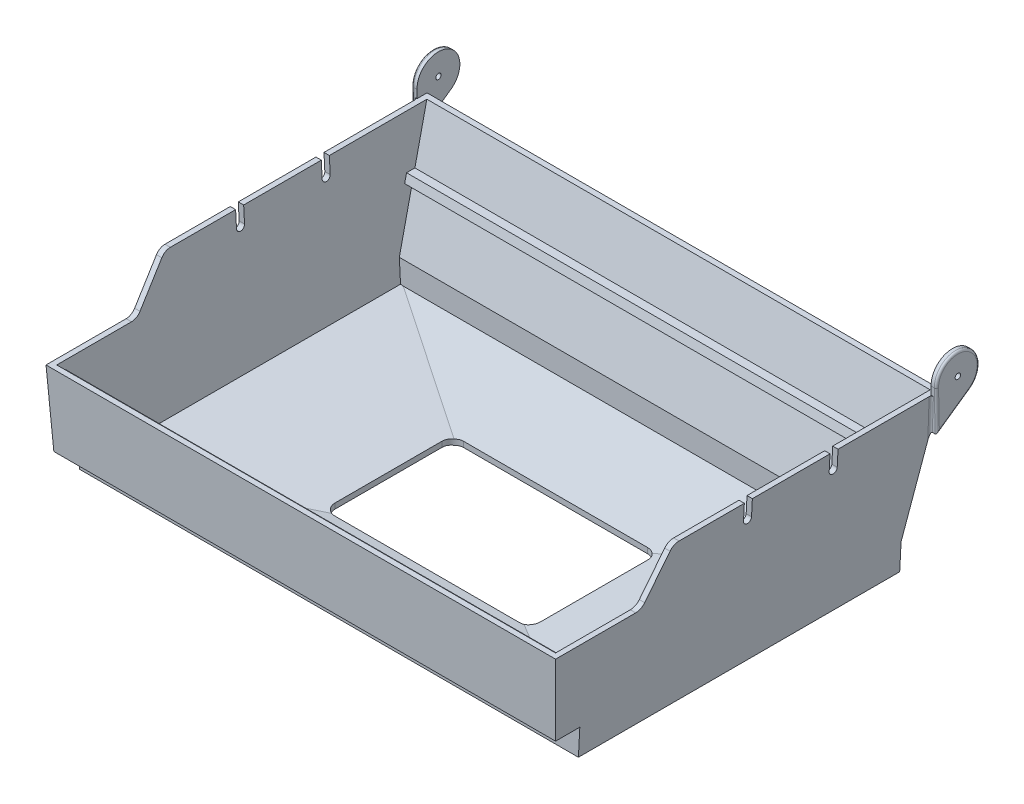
ISO-10303-21;
HEADER;
FILE_DESCRIPTION(('STEP AP214'),'2;1');
FILE_NAME('part.step','',(''),(''),'','','');
FILE_SCHEMA(('AUTOMOTIVE_DESIGN { 1 0 10303 214 1 1 1 1 }'));
ENDSEC;
DATA;
#1=APPLICATION_CONTEXT('core data for automotive mechanical design processes');
#2=APPLICATION_PROTOCOL_DEFINITION('international standard','automotive_design',2000,#1);
#3=PRODUCT_CONTEXT('',#1,'mechanical');
#4=PRODUCT('Part','Part','',(#3));
#5=PRODUCT_RELATED_PRODUCT_CATEGORY('part','',(#4));
#6=PRODUCT_DEFINITION_FORMATION('','',#4);
#7=PRODUCT_DEFINITION_CONTEXT('part definition',#1,'design');
#8=PRODUCT_DEFINITION('design','',#6,#7);
#9=PRODUCT_DEFINITION_SHAPE('','',#8);
#10=(LENGTH_UNIT() NAMED_UNIT(*) SI_UNIT(.MILLI.,.METRE.));
#11=(NAMED_UNIT(*) PLANE_ANGLE_UNIT() SI_UNIT($,.RADIAN.));
#12=(NAMED_UNIT(*) SI_UNIT($,.STERADIAN.) SOLID_ANGLE_UNIT());
#13=UNCERTAINTY_MEASURE_WITH_UNIT(LENGTH_MEASURE(1.E-05),#10,'distance_accuracy_value','');
#14=(GEOMETRIC_REPRESENTATION_CONTEXT(3) GLOBAL_UNCERTAINTY_ASSIGNED_CONTEXT((#13)) GLOBAL_UNIT_ASSIGNED_CONTEXT((#10,
#11,#12)) REPRESENTATION_CONTEXT('',''));
#15=CARTESIAN_POINT('',(0.,0.,0.));
#16=DIRECTION('',(0.,0.,1.));
#17=DIRECTION('',(1.,0.,0.));
#18=AXIS2_PLACEMENT_3D('',#15,#16,#17);
#19=CARTESIAN_POINT('',(-298.458702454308,0.332333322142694,228.6));
#20=DIRECTION('',(-0.998629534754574,-0.0523359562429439,0.));
#21=DIRECTION('',(0.0523359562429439,-0.998629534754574,0.));
#22=AXIS2_PLACEMENT_3D('',#19,#20,#21);
#23=PLANE('',#22);
#24=DIRECTION('',(0.,0.,1.));
#25=VECTOR('',#24,1.);
#26=CARTESIAN_POINT('',(-295.279786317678,-60.325,-204.655120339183));
#27=LINE('',#26,#25);
#28=CARTESIAN_POINT('',(-295.279786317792,-60.325,-204.655120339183));
#29=VERTEX_POINT('',#28);
#30=CARTESIAN_POINT('',(-295.279786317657,-60.3249999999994,-194.744529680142));
#31=VERTEX_POINT('',#30);
#32=EDGE_CURVE('E637',#29,#31,#27,.T.);
#33=ORIENTED_EDGE('',*,*,#32,.F.);
#34=DIRECTION('',(-0.0503049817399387,0.959876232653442,-0.275875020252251));
#35=VECTOR('',#34,1.);
#36=CARTESIAN_POINT('',(-292.204098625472,-119.012617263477,-187.787896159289));
#37=LINE('',#36,#35);
#38=CARTESIAN_POINT('',(-298.441285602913,0.,-221.992939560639));
#39=VERTEX_POINT('',#38);
#40=EDGE_CURVE('E783',#29,#39,#37,.T.);
#41=ORIENTED_EDGE('',*,*,#40,.T.);
#42=DIRECTION('',(0.,0.,1.));
#43=VECTOR('',#42,1.);
#44=CARTESIAN_POINT('',(-298.441285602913,0.,-228.6));
#45=LINE('',#44,#43);
#46=CARTESIAN_POINT('',(-298.441285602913,0.,-106.3625));
#47=VERTEX_POINT('',#46);
#48=EDGE_CURVE('E859',#39,#47,#45,.T.);
#49=ORIENTED_EDGE('',*,*,#48,.T.);
#50=DIRECTION('',(0.0523359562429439,-0.998629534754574,0.));
#51=VECTOR('',#50,1.);
#52=CARTESIAN_POINT('',(-298.458702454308,0.332333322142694,-106.3625));
#53=LINE('',#52,#51);
#54=CARTESIAN_POINT('',(-297.442917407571,-19.05,-106.3625));
#55=VERTEX_POINT('',#54);
#56=EDGE_CURVE('E714',#47,#55,#53,.T.);
#57=ORIENTED_EDGE('',*,*,#56,.T.);
#58=CARTESIAN_POINT('',(-297.442917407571,-19.05,-101.6));
#59=DIRECTION('',(-0.998629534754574,-0.0523359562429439,0.));
#60=DIRECTION('',(0.0523359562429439,-0.998629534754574,0.));
#61=AXIS2_PLACEMENT_3D('',#58,#59,#60);
#62=ELLIPSE('',#61,4.7690357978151,4.7625);
#63=CARTESIAN_POINT('',(-297.442917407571,-19.05,-96.8375));
#64=VERTEX_POINT('',#63);
#65=EDGE_CURVE('E707',#55,#64,#62,.T.);
#66=ORIENTED_EDGE('',*,*,#65,.T.);
#67=DIRECTION('',(-0.0523359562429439,0.998629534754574,0.));
#68=VECTOR('',#67,1.);
#69=CARTESIAN_POINT('',(-298.458702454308,0.332333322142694,-96.8375));
#70=LINE('',#69,#68);
#71=CARTESIAN_POINT('',(-298.441285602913,0.,-96.8375));
#72=VERTEX_POINT('',#71);
#73=EDGE_CURVE('E689',#64,#72,#70,.T.);
#74=ORIENTED_EDGE('',*,*,#73,.T.);
#75=CARTESIAN_POINT('',(-298.441285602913,0.,-4.7625));
#76=VERTEX_POINT('',#75);
#77=EDGE_CURVE('E862',#72,#76,#45,.T.);
#78=ORIENTED_EDGE('',*,*,#77,.T.);
#79=DIRECTION('',(0.0523359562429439,-0.998629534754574,0.));
#80=VECTOR('',#79,1.);
#81=CARTESIAN_POINT('',(-298.458702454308,0.332333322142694,-4.7625));
#82=LINE('',#81,#80);
#83=CARTESIAN_POINT('',(-297.442917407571,-19.05,-4.7625));
#84=VERTEX_POINT('',#83);
#85=EDGE_CURVE('E750',#76,#84,#82,.T.);
#86=ORIENTED_EDGE('',*,*,#85,.T.);
#87=CARTESIAN_POINT('',(-297.442917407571,-19.05,0.));
#88=DIRECTION('',(-0.998629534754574,-0.0523359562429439,0.));
#89=DIRECTION('',(0.0523359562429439,-0.998629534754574,0.));
#90=AXIS2_PLACEMENT_3D('',#87,#88,#89);
#91=ELLIPSE('',#90,4.7690357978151,4.7625);
#92=CARTESIAN_POINT('',(-297.442917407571,-19.05,4.7625));
#93=VERTEX_POINT('',#92);
#94=EDGE_CURVE('E743',#84,#93,#91,.T.);
#95=ORIENTED_EDGE('',*,*,#94,.T.);
#96=DIRECTION('',(-0.0523359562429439,0.998629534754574,0.));
#97=VECTOR('',#96,1.);
#98=CARTESIAN_POINT('',(-298.458702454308,0.332333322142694,4.7625));
#99=LINE('',#98,#97);
#100=CARTESIAN_POINT('',(-298.441285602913,0.,4.7625));
#101=VERTEX_POINT('',#100);
#102=EDGE_CURVE('E725',#93,#101,#99,.T.);
#103=ORIENTED_EDGE('',*,*,#102,.T.);
#104=CARTESIAN_POINT('',(-298.441285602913,0.,82.1559403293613));
#105=VERTEX_POINT('',#104);
#106=EDGE_CURVE('E837',#101,#105,#45,.T.);
#107=ORIENTED_EDGE('',*,*,#106,.T.);
#108=CARTESIAN_POINT('',(-297.775706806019,-12.7,82.1559403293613));
#109=DIRECTION('',(-0.998629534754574,-0.0523359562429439,0.));
#110=DIRECTION('',(-0.0523359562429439,0.998629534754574,0.));
#111=AXIS2_PLACEMENT_3D('',#108,#109,#110);
#112=ELLIPSE('',#111,12.7174287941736,12.7);
#113=CARTESIAN_POINT('',(-298.157467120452,-5.41557925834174,92.5591712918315));
#114=VERTEX_POINT('',#113);
#115=EDGE_CURVE('E847',#114,#105,#112,.T.);
#116=ORIENTED_EDGE('',*,*,#115,.F.);
#117=DIRECTION('',(0.0428904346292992,-0.818398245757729,0.573048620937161));
#118=VECTOR('',#117,1.);
#119=CARTESIAN_POINT('',(-295.016128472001,-65.3558913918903,134.529829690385));
#120=LINE('',#119,#118);
#121=CARTESIAN_POINT('',(-296.062788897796,-45.3844207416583,120.545655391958));
#122=VERTEX_POINT('',#121);
#123=EDGE_CURVE('E843',#114,#122,#120,.T.);
#124=ORIENTED_EDGE('',*,*,#123,.T.);
#125=CARTESIAN_POINT('',(-296.444549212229,-38.1,130.948886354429));
#126=DIRECTION('',(-0.998629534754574,-0.0523359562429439,0.));
#127=DIRECTION('',(-0.0523359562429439,0.998629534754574,0.));
#128=AXIS2_PLACEMENT_3D('',#125,#126,#127);
#129=ELLIPSE('',#128,12.7174287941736,12.7);
#130=CARTESIAN_POINT('',(-295.778970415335,-50.8,130.948886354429));
#131=VERTEX_POINT('',#130);
#132=EDGE_CURVE('E821',#131,#122,#129,.F.);
#133=ORIENTED_EDGE('',*,*,#132,.F.);
#134=DIRECTION('',(0.,0.,1.));
#135=VECTOR('',#134,1.);
#136=CARTESIAN_POINT('',(-295.778970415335,-50.8,228.6));
#137=LINE('',#136,#135);
#138=CARTESIAN_POINT('',(-295.778970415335,-50.8,219.578970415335));
#139=VERTEX_POINT('',#138);
#140=EDGE_CURVE('E834',#131,#139,#137,.T.);
#141=ORIENTED_EDGE('',*,*,#140,.T.);
#142=DIRECTION('',(-0.052264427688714,0.997264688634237,0.052264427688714));
#143=VECTOR('',#142,1.);
#144=CARTESIAN_POINT('',(-298.476024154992,0.662851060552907,222.276024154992));
#145=LINE('',#144,#143);
#146=CARTESIAN_POINT('',(-295.279786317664,-60.325,219.079786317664));
#147=VERTEX_POINT('',#146);
#148=EDGE_CURVE('E779',#147,#139,#145,.T.);
#149=ORIENTED_EDGE('',*,*,#148,.F.);
#150=DIRECTION('',(0.,0.,1.));
#151=VECTOR('',#150,1.);
#152=CARTESIAN_POINT('',(-295.279786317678,-60.325,219.079786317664));
#153=LINE('',#152,#151);
#154=CARTESIAN_POINT('',(-295.279786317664,-60.325,209.554786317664));
#155=VERTEX_POINT('',#154);
#156=EDGE_CURVE('E653',#155,#147,#153,.T.);
#157=ORIENTED_EDGE('',*,*,#156,.F.);
#158=DIRECTION('',(-0.052264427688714,0.997264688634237,0.052264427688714));
#159=VECTOR('',#158,1.);
#160=CARTESIAN_POINT('',(-1660.25840960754,25985.0186868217,1574.53340960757));
#161=LINE('',#160,#159);
#162=CARTESIAN_POINT('',(-294.780602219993,-69.85,209.055602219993));
#163=VERTEX_POINT('',#162);
#164=EDGE_CURVE('E661',#163,#155,#161,.T.);
#165=ORIENTED_EDGE('',*,*,#164,.F.);
#166=DIRECTION('',(0.,0.,-1.));
#167=VECTOR('',#166,1.);
#168=CARTESIAN_POINT('',(-294.780602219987,-69.85,218.580602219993));
#169=LINE('',#168,#167);
#170=CARTESIAN_POINT('',(-294.780602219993,-69.85,218.580602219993));
#171=VERTEX_POINT('',#170);
#172=EDGE_CURVE('E664',#171,#163,#169,.T.);
#173=ORIENTED_EDGE('',*,*,#172,.F.);
#174=CARTESIAN_POINT('',(-291.45270823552,-133.35,215.25270823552));
#175=VERTEX_POINT('',#174);
#176=EDGE_CURVE('E775',#175,#171,#145,.T.);
#177=ORIENTED_EDGE('',*,*,#176,.F.);
#178=DIRECTION('',(0.,0.,-1.));
#179=VECTOR('',#178,1.);
#180=CARTESIAN_POINT('',(-291.45270823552,-133.35,228.6));
#181=LINE('',#180,#179);
#182=CARTESIAN_POINT('',(-291.45270823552,-133.35,186.200739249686));
#183=VERTEX_POINT('',#182);
#184=EDGE_CURVE('E772',#175,#183,#181,.T.);
#185=ORIENTED_EDGE('',*,*,#184,.T.);
#186=DIRECTION('',(0.0523359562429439,-0.998629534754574,0.));
#187=VECTOR('',#186,1.);
#188=CARTESIAN_POINT('',(-298.458702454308,0.332333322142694,186.200739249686));
#189=LINE('',#188,#187);
#190=CARTESIAN_POINT('',(-289.756596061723,-165.713748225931,186.200739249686));
#191=VERTEX_POINT('',#190);
#192=EDGE_CURVE('E767',#183,#191,#189,.T.);
#193=ORIENTED_EDGE('',*,*,#192,.T.);
#194=DIRECTION('',(0.,0.,1.));
#195=VECTOR('',#194,1.);
#196=CARTESIAN_POINT('',(-289.756596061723,-165.713748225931,228.6));
#197=LINE('',#196,#195);
#198=CARTESIAN_POINT('',(-289.756596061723,-165.713748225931,-182.099260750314));
#199=VERTEX_POINT('',#198);
#200=EDGE_CURVE('E762',#199,#191,#197,.T.);
#201=ORIENTED_EDGE('',*,*,#200,.F.);
#202=DIRECTION('',(-0.0523359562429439,0.998629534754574,0.));
#203=VECTOR('',#202,1.);
#204=CARTESIAN_POINT('',(-298.458702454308,0.332333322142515,-182.099260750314));
#205=LINE('',#204,#203);
#206=CARTESIAN_POINT('',(-291.16679303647,-138.805586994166,-182.099260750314));
#207=VERTEX_POINT('',#206);
#208=EDGE_CURVE('E758',#199,#207,#205,.T.);
#209=ORIENTED_EDGE('',*,*,#208,.T.);
#210=CARTESIAN_POINT('',(-294.780602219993,-69.85,-201.917569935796));
#211=VERTEX_POINT('',#210);
#212=EDGE_CURVE('E780',#207,#211,#37,.T.);
#213=ORIENTED_EDGE('',*,*,#212,.T.);
#214=DIRECTION('',(0.,0.,-1.));
#215=VECTOR('',#214,1.);
#216=CARTESIAN_POINT('',(-294.780602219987,-69.85,-201.917569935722));
#217=LINE('',#216,#215);
#218=CARTESIAN_POINT('',(-294.780602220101,-69.85,-192.006979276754));
#219=VERTEX_POINT('',#218);
#220=EDGE_CURVE('E632',#219,#211,#217,.T.);
#221=ORIENTED_EDGE('',*,*,#220,.F.);
#222=DIRECTION('',(0.0503049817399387,-0.959876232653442,0.275875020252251));
#223=VECTOR('',#222,1.);
#224=CARTESIAN_POINT('',(-1559.82814782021,24068.6951340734,-7129.59059806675));
#225=LINE('',#224,#223);
#226=EDGE_CURVE('E634',#31,#219,#225,.T.);
#227=ORIENTED_EDGE('',*,*,#226,.F.);
#228=EDGE_LOOP('',(#33,#41,#49,#57,#66,#74,#78,#86,#95,#103,#107,#116,#124,#133,#141,#149,#157,
#165,#173,#177,#185,#193,#201,#209,#213,#221,#227));
#229=FACE_BOUND('',#228,.T.);
#230=ADVANCED_FACE('F36',(#229),#23,.F.);
#231=CARTESIAN_POINT('',(298.458702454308,0.332333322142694,228.6));
#232=DIRECTION('',(0.998629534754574,-0.0523359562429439,0.));
#233=DIRECTION('',(0.0523359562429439,0.998629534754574,0.));
#234=AXIS2_PLACEMENT_3D('',#231,#232,#233);
#235=PLANE('',#234);
#236=DIRECTION('',(0.,0.,1.));
#237=VECTOR('',#236,1.);
#238=CARTESIAN_POINT('',(295.279786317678,-60.325,-204.655120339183));
#239=LINE('',#238,#237);
#240=CARTESIAN_POINT('',(295.279786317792,-60.325,-204.655120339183));
#241=VERTEX_POINT('',#240);
#242=CARTESIAN_POINT('',(295.279786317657,-60.3249999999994,-194.744529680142));
#243=VERTEX_POINT('',#242);
#244=EDGE_CURVE('E649',#241,#243,#239,.T.);
#245=ORIENTED_EDGE('',*,*,#244,.T.);
#246=DIRECTION('',(-0.0503049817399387,-0.959876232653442,0.275875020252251));
#247=VECTOR('',#246,1.);
#248=CARTESIAN_POINT('',(1559.82814782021,24068.6951340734,-7129.59059806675));
#249=LINE('',#248,#247);
#250=CARTESIAN_POINT('',(294.780602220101,-69.85,-192.006979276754));
#251=VERTEX_POINT('',#250);
#252=EDGE_CURVE('E654',#243,#251,#249,.T.);
#253=ORIENTED_EDGE('',*,*,#252,.T.);
#254=DIRECTION('',(0.,0.,-1.));
#255=VECTOR('',#254,1.);
#256=CARTESIAN_POINT('',(294.780602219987,-69.85,-201.917569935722));
#257=LINE('',#256,#255);
#258=CARTESIAN_POINT('',(294.780602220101,-69.85,-201.917569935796));
#259=VERTEX_POINT('',#258);
#260=EDGE_CURVE('E650',#251,#259,#257,.T.);
#261=ORIENTED_EDGE('',*,*,#260,.T.);
#262=DIRECTION('',(-0.0503049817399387,-0.959876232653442,0.275875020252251));
#263=VECTOR('',#262,1.);
#264=CARTESIAN_POINT('',(292.204098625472,-119.012617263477,-187.787896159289));
#265=LINE('',#264,#263);
#266=CARTESIAN_POINT('',(291.16679303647,-138.805586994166,-182.099260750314));
#267=VERTEX_POINT('',#266);
#268=EDGE_CURVE('E791',#259,#267,#265,.T.);
#269=ORIENTED_EDGE('',*,*,#268,.T.);
#270=DIRECTION('',(-0.0523359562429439,-0.998629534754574,0.));
#271=VECTOR('',#270,1.);
#272=CARTESIAN_POINT('',(298.458702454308,0.332333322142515,-182.099260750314));
#273=LINE('',#272,#271);
#274=CARTESIAN_POINT('',(289.756596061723,-165.713748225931,-182.099260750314));
#275=VERTEX_POINT('',#274);
#276=EDGE_CURVE('E761',#267,#275,#273,.T.);
#277=ORIENTED_EDGE('',*,*,#276,.T.);
#278=DIRECTION('',(0.,0.,1.));
#279=VECTOR('',#278,1.);
#280=CARTESIAN_POINT('',(289.756596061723,-165.713748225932,-1523.56931417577));
#281=LINE('',#280,#279);
#282=CARTESIAN_POINT('',(289.756596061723,-165.713748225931,186.200739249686));
#283=VERTEX_POINT('',#282);
#284=EDGE_CURVE('E765',#275,#283,#281,.T.);
#285=ORIENTED_EDGE('',*,*,#284,.T.);
#286=DIRECTION('',(0.0523359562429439,0.998629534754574,0.));
#287=VECTOR('',#286,1.);
#288=CARTESIAN_POINT('',(298.458702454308,0.332333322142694,186.200739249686));
#289=LINE('',#288,#287);
#290=CARTESIAN_POINT('',(291.45270823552,-133.35,186.200739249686));
#291=VERTEX_POINT('',#290);
#292=EDGE_CURVE('E771',#283,#291,#289,.T.);
#293=ORIENTED_EDGE('',*,*,#292,.T.);
#294=DIRECTION('',(0.,0.,1.));
#295=VECTOR('',#294,1.);
#296=CARTESIAN_POINT('',(291.45270823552,-133.35,228.6));
#297=LINE('',#296,#295);
#298=CARTESIAN_POINT('',(291.45270823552,-133.35,215.25270823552));
#299=VERTEX_POINT('',#298);
#300=EDGE_CURVE('E770',#291,#299,#297,.T.);
#301=ORIENTED_EDGE('',*,*,#300,.T.);
#302=DIRECTION('',(0.052264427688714,0.997264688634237,0.052264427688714));
#303=VECTOR('',#302,1.);
#304=CARTESIAN_POINT('',(298.476024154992,0.662851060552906,222.276024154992));
#305=LINE('',#304,#303);
#306=CARTESIAN_POINT('',(294.780602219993,-69.85,218.580602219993));
#307=VERTEX_POINT('',#306);
#308=EDGE_CURVE('E800',#299,#307,#305,.T.);
#309=ORIENTED_EDGE('',*,*,#308,.T.);
#310=DIRECTION('',(0.,0.,-1.));
#311=VECTOR('',#310,1.);
#312=CARTESIAN_POINT('',(294.780602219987,-69.85,218.580602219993));
#313=LINE('',#312,#311);
#314=CARTESIAN_POINT('',(294.780602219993,-69.85,209.055602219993));
#315=VERTEX_POINT('',#314);
#316=EDGE_CURVE('E671',#307,#315,#313,.T.);
#317=ORIENTED_EDGE('',*,*,#316,.T.);
#318=DIRECTION('',(0.052264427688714,0.997264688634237,0.052264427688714));
#319=VECTOR('',#318,1.);
#320=CARTESIAN_POINT('',(1660.25840960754,25985.0186868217,1574.53340960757));
#321=LINE('',#320,#319);
#322=CARTESIAN_POINT('',(295.279786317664,-60.325,209.554786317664));
#323=VERTEX_POINT('',#322);
#324=EDGE_CURVE('E683',#315,#323,#321,.T.);
#325=ORIENTED_EDGE('',*,*,#324,.T.);
#326=DIRECTION('',(0.,0.,1.));
#327=VECTOR('',#326,1.);
#328=CARTESIAN_POINT('',(295.279786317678,-60.325,219.079786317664));
#329=LINE('',#328,#327);
#330=CARTESIAN_POINT('',(295.279786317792,-60.325,219.079786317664));
#331=VERTEX_POINT('',#330);
#332=EDGE_CURVE('E679',#323,#331,#329,.T.);
#333=ORIENTED_EDGE('',*,*,#332,.T.);
#334=CARTESIAN_POINT('',(295.778970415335,-50.8,219.578970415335));
#335=VERTEX_POINT('',#334);
#336=EDGE_CURVE('E778',#331,#335,#305,.T.);
#337=ORIENTED_EDGE('',*,*,#336,.T.);
#338=DIRECTION('',(0.,0.,-1.));
#339=VECTOR('',#338,1.);
#340=CARTESIAN_POINT('',(295.778970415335,-50.8,228.6));
#341=LINE('',#340,#339);
#342=CARTESIAN_POINT('',(295.778970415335,-50.8,130.948886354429));
#343=VERTEX_POINT('',#342);
#344=EDGE_CURVE('E838',#335,#343,#341,.T.);
#345=ORIENTED_EDGE('',*,*,#344,.T.);
#346=CARTESIAN_POINT('',(296.444549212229,-38.1,130.948886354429));
#347=DIRECTION('',(0.998629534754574,-0.0523359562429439,0.));
#348=DIRECTION('',(-0.0523359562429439,-0.998629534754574,0.));
#349=AXIS2_PLACEMENT_3D('',#346,#347,#348);
#350=ELLIPSE('',#349,12.7174287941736,12.7);
#351=CARTESIAN_POINT('',(296.062788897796,-45.3844207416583,120.545655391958));
#352=VERTEX_POINT('',#351);
#353=EDGE_CURVE('E844',#352,#343,#350,.F.);
#354=ORIENTED_EDGE('',*,*,#353,.F.);
#355=DIRECTION('',(0.0428904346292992,0.818398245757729,-0.573048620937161));
#356=VECTOR('',#355,1.);
#357=CARTESIAN_POINT('',(295.016128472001,-65.3558913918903,134.529829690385));
#358=LINE('',#357,#356);
#359=CARTESIAN_POINT('',(298.157467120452,-5.41557925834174,92.5591712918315));
#360=VERTEX_POINT('',#359);
#361=EDGE_CURVE('E841',#352,#360,#358,.T.);
#362=ORIENTED_EDGE('',*,*,#361,.T.);
#363=CARTESIAN_POINT('',(297.775706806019,-12.7,82.1559403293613));
#364=DIRECTION('',(0.998629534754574,-0.0523359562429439,0.));
#365=DIRECTION('',(-0.0523359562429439,-0.998629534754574,0.));
#366=AXIS2_PLACEMENT_3D('',#363,#364,#365);
#367=ELLIPSE('',#366,12.7174287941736,12.7);
#368=CARTESIAN_POINT('',(298.441285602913,0.,82.1559403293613));
#369=VERTEX_POINT('',#368);
#370=EDGE_CURVE('E803',#369,#360,#367,.T.);
#371=ORIENTED_EDGE('',*,*,#370,.F.);
#372=DIRECTION('',(0.,0.,-1.));
#373=VECTOR('',#372,1.);
#374=CARTESIAN_POINT('',(298.441285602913,0.,-228.6));
#375=LINE('',#374,#373);
#376=CARTESIAN_POINT('',(298.441285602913,0.,4.7625));
#377=VERTEX_POINT('',#376);
#378=EDGE_CURVE('E851',#369,#377,#375,.T.);
#379=ORIENTED_EDGE('',*,*,#378,.T.);
#380=DIRECTION('',(-0.0523359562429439,-0.998629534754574,0.));
#381=VECTOR('',#380,1.);
#382=CARTESIAN_POINT('',(298.458702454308,0.332333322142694,4.7625));
#383=LINE('',#382,#381);
#384=CARTESIAN_POINT('',(297.442917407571,-19.05,4.7625));
#385=VERTEX_POINT('',#384);
#386=EDGE_CURVE('E1236',#377,#385,#383,.T.);
#387=ORIENTED_EDGE('',*,*,#386,.T.);
#388=CARTESIAN_POINT('',(297.442917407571,-19.05,0.));
#389=DIRECTION('',(0.998629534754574,-0.0523359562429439,0.));
#390=DIRECTION('',(0.0523359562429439,0.998629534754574,0.));
#391=AXIS2_PLACEMENT_3D('',#388,#389,#390);
#392=ELLIPSE('',#391,4.7690357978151,4.7625);
#393=CARTESIAN_POINT('',(297.442917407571,-19.05,-4.7625));
#394=VERTEX_POINT('',#393);
#395=EDGE_CURVE('E1239',#385,#394,#392,.T.);
#396=ORIENTED_EDGE('',*,*,#395,.T.);
#397=DIRECTION('',(0.0523359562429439,0.998629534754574,0.));
#398=VECTOR('',#397,1.);
#399=CARTESIAN_POINT('',(298.458702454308,0.332333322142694,-4.7625));
#400=LINE('',#399,#398);
#401=CARTESIAN_POINT('',(298.441285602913,0.,-4.7625));
#402=VERTEX_POINT('',#401);
#403=EDGE_CURVE('E1242',#394,#402,#400,.T.);
#404=ORIENTED_EDGE('',*,*,#403,.T.);
#405=CARTESIAN_POINT('',(298.441285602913,0.,-96.8375));
#406=VERTEX_POINT('',#405);
#407=EDGE_CURVE('E855',#402,#406,#375,.T.);
#408=ORIENTED_EDGE('',*,*,#407,.T.);
#409=DIRECTION('',(-0.0523359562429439,-0.998629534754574,0.));
#410=VECTOR('',#409,1.);
#411=CARTESIAN_POINT('',(298.458702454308,0.332333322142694,-96.8375));
#412=LINE('',#411,#410);
#413=CARTESIAN_POINT('',(297.442917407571,-19.05,-96.8375));
#414=VERTEX_POINT('',#413);
#415=EDGE_CURVE('E1245',#406,#414,#412,.T.);
#416=ORIENTED_EDGE('',*,*,#415,.T.);
#417=CARTESIAN_POINT('',(297.442917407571,-19.05,-101.6));
#418=DIRECTION('',(0.998629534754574,-0.0523359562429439,0.));
#419=DIRECTION('',(0.0523359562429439,0.998629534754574,0.));
#420=AXIS2_PLACEMENT_3D('',#417,#418,#419);
#421=ELLIPSE('',#420,4.7690357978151,4.7625);
#422=CARTESIAN_POINT('',(297.442917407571,-19.05,-106.3625));
#423=VERTEX_POINT('',#422);
#424=EDGE_CURVE('E1248',#414,#423,#421,.T.);
#425=ORIENTED_EDGE('',*,*,#424,.T.);
#426=DIRECTION('',(0.0523359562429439,0.998629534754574,0.));
#427=VECTOR('',#426,1.);
#428=CARTESIAN_POINT('',(298.458702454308,0.332333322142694,-106.3625));
#429=LINE('',#428,#427);
#430=CARTESIAN_POINT('',(298.441285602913,0.,-106.3625));
#431=VERTEX_POINT('',#430);
#432=EDGE_CURVE('E1251',#423,#431,#429,.T.);
#433=ORIENTED_EDGE('',*,*,#432,.T.);
#434=CARTESIAN_POINT('',(298.441285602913,0.,-221.992939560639));
#435=VERTEX_POINT('',#434);
#436=EDGE_CURVE('E856',#431,#435,#375,.T.);
#437=ORIENTED_EDGE('',*,*,#436,.T.);
#438=EDGE_CURVE('E797',#435,#241,#265,.T.);
#439=ORIENTED_EDGE('',*,*,#438,.T.);
#440=EDGE_LOOP('',(#245,#253,#261,#269,#277,#285,#293,#301,#309,#317,#325,#333,#337,#345,#354,
#362,#371,#379,#387,#396,#404,#408,#416,#425,#433,#437,#439));
#441=FACE_BOUND('',#440,.T.);
#442=ADVANCED_FACE('F1034',(#441),#235,.F.);
#443=CARTESIAN_POINT('',(-304.8,-137.945972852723,-182.346319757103));
#444=DIRECTION('',(0.,0.276224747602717,0.961093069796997));
#445=DIRECTION('',(0.,-0.961093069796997,0.276224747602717));
#446=AXIS2_PLACEMENT_3D('',#443,#444,#445);
#447=PLANE('',#446);
#448=ORIENTED_EDGE('',*,*,#40,.F.);
#449=DIRECTION('',(-1.,0.,0.));
#450=VECTOR('',#449,1.);
#451=CARTESIAN_POINT('',(500000.,-60.325,-204.655120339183));
#452=LINE('',#451,#450);
#453=EDGE_CURVE('E647',#241,#29,#452,.T.);
#454=ORIENTED_EDGE('',*,*,#453,.F.);
#455=ORIENTED_EDGE('',*,*,#438,.F.);
#456=DIRECTION('',(-1.,0.,0.));
#457=VECTOR('',#456,1.);
#458=CARTESIAN_POINT('',(-304.8,0.,-221.992939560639));
#459=LINE('',#458,#457);
#460=EDGE_CURVE('E854',#435,#39,#459,.T.);
#461=ORIENTED_EDGE('',*,*,#460,.T.);
#462=EDGE_LOOP('',(#448,#454,#455,#461));
#463=FACE_BOUND('',#462,.T.);
#464=ADVANCED_FACE('F1040',(#463),#447,.T.);
#465=ORIENTED_EDGE('',*,*,#268,.F.);
#466=DIRECTION('',(-1.,0.,0.));
#467=VECTOR('',#466,1.);
#468=CARTESIAN_POINT('',(500000.,-69.85,-201.917569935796));
#469=LINE('',#468,#467);
#470=EDGE_CURVE('E640',#259,#211,#469,.T.);
#471=ORIENTED_EDGE('',*,*,#470,.T.);
#472=ORIENTED_EDGE('',*,*,#212,.F.);
#473=DIRECTION('',(1.,0.,0.));
#474=VECTOR('',#473,1.);
#475=CARTESIAN_POINT('',(-304.8,-138.805586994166,-182.099260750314));
#476=LINE('',#475,#474);
#477=EDGE_CURVE('E774',#207,#267,#476,.T.);
#478=ORIENTED_EDGE('',*,*,#477,.T.);
#479=EDGE_LOOP('',(#465,#471,#472,#478));
#480=FACE_BOUND('',#479,.T.);
#481=ADVANCED_FACE('F1062',(#480),#447,.T.);
#482=CARTESIAN_POINT('',(304.8,0.332333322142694,222.258702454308));
#483=DIRECTION('',(0.,-0.0523359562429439,0.998629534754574));
#484=DIRECTION('',(0.,-0.998629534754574,-0.0523359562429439));
#485=AXIS2_PLACEMENT_3D('',#482,#483,#484);
#486=PLANE('',#485);
#487=DIRECTION('',(-1.,0.,0.));
#488=VECTOR('',#487,1.);
#489=CARTESIAN_POINT('',(500000.,-69.85,218.580602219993));
#490=LINE('',#489,#488);
#491=EDGE_CURVE('E668',#307,#171,#490,.T.);
#492=ORIENTED_EDGE('',*,*,#491,.F.);
#493=ORIENTED_EDGE('',*,*,#308,.F.);
#494=DIRECTION('',(1.,0.,0.));
#495=VECTOR('',#494,1.);
#496=CARTESIAN_POINT('',(-304.8,-133.35,215.25270823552));
#497=LINE('',#496,#495);
#498=EDGE_CURVE('E793',#175,#299,#497,.T.);
#499=ORIENTED_EDGE('',*,*,#498,.F.);
#500=ORIENTED_EDGE('',*,*,#176,.T.);
#501=EDGE_LOOP('',(#492,#493,#499,#500));
#502=FACE_BOUND('',#501,.T.);
#503=ADVANCED_FACE('F1058',(#502),#486,.F.);
#504=DIRECTION('',(-1.,0.,0.));
#505=VECTOR('',#504,1.);
#506=CARTESIAN_POINT('',(500000.,-60.325,219.079786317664));
#507=LINE('',#506,#505);
#508=EDGE_CURVE('E667',#331,#147,#507,.T.);
#509=ORIENTED_EDGE('',*,*,#508,.T.);
#510=ORIENTED_EDGE('',*,*,#148,.T.);
#511=DIRECTION('',(1.,0.,0.));
#512=VECTOR('',#511,1.);
#513=CARTESIAN_POINT('',(304.8,-50.8,219.578970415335));
#514=LINE('',#513,#512);
#515=EDGE_CURVE('E760',#139,#335,#514,.T.);
#516=ORIENTED_EDGE('',*,*,#515,.T.);
#517=ORIENTED_EDGE('',*,*,#336,.F.);
#518=EDGE_LOOP('',(#509,#510,#516,#517));
#519=FACE_BOUND('',#518,.T.);
#520=ADVANCED_FACE('F1061',(#519),#486,.F.);
#521=CARTESIAN_POINT('',(-304.8,0.,-228.6));
#522=DIRECTION('',(0.,1.,0.));
#523=DIRECTION('',(0.,0.,1.));
#524=AXIS2_PLACEMENT_3D('',#521,#522,#523);
#525=PLANE('',#524);
#526=DIRECTION('',(1.,0.,0.));
#527=VECTOR('',#526,1.);
#528=CARTESIAN_POINT('',(-304.8,0.,-106.3625));
#529=LINE('',#528,#527);
#530=CARTESIAN_POINT('',(304.8,0.,-106.3625));
#531=VERTEX_POINT('',#530);
#532=EDGE_CURVE('E690',#431,#531,#529,.T.);
#533=ORIENTED_EDGE('',*,*,#532,.T.);
#534=DIRECTION('',(0.,0.,-1.));
#535=VECTOR('',#534,1.);
#536=CARTESIAN_POINT('',(304.8,0.,228.6));
#537=LINE('',#536,#535);
#538=CARTESIAN_POINT('',(304.8,0.,-214.351280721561));
#539=VERTEX_POINT('',#538);
#540=EDGE_CURVE('E937',#531,#539,#537,.T.);
#541=ORIENTED_EDGE('',*,*,#540,.T.);
#542=CARTESIAN_POINT('',(307.343485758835,0.,-214.348626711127));
#543=DIRECTION('',(0.,1.,0.));
#544=DIRECTION('',(-0.934487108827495,0.,-0.355996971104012));
#545=AXIS2_PLACEMENT_3D('',#542,#543,#544);
#546=ELLIPSE('',#545,2.54399123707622,2.54);
#547=CARTESIAN_POINT('',(307.340828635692,0.,-216.889132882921));
#548=VERTEX_POINT('',#547);
#549=EDGE_CURVE('E949',#539,#548,#546,.F.);
#550=ORIENTED_EDGE('',*,*,#549,.T.);
#551=DIRECTION('',(1.,0.,0.));
#552=VECTOR('',#551,1.);
#553=CARTESIAN_POINT('',(-304.8,0.,-216.889132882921));
#554=LINE('',#553,#552);
#555=CARTESIAN_POINT('',(304.8,0.,-216.889132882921));
#556=VERTEX_POINT('',#555);
#557=EDGE_CURVE('E55',#556,#548,#554,.T.);
#558=ORIENTED_EDGE('',*,*,#557,.F.);
#559=DIRECTION('',(0.,0.,-1.));
#560=VECTOR('',#559,1.);
#561=CARTESIAN_POINT('',(304.8,0.,-242.091350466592));
#562=LINE('',#561,#560);
#563=CARTESIAN_POINT('',(304.8,0.,-228.6));
#564=VERTEX_POINT('',#563);
#565=EDGE_CURVE('E526',#556,#564,#562,.T.);
#566=ORIENTED_EDGE('',*,*,#565,.T.);
#567=DIRECTION('',(-1.,0.,0.));
#568=VECTOR('',#567,1.);
#569=CARTESIAN_POINT('',(304.8,0.,-228.6));
#570=LINE('',#569,#568);
#571=CARTESIAN_POINT('',(-304.8,0.,-228.6));
#572=VERTEX_POINT('',#571);
#573=EDGE_CURVE('E1196',#564,#572,#570,.T.);
#574=ORIENTED_EDGE('',*,*,#573,.T.);
#575=DIRECTION('',(0.,0.,-1.));
#576=VECTOR('',#575,1.);
#577=CARTESIAN_POINT('',(-304.8,0.,-242.091350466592));
#578=LINE('',#577,#576);
#579=CARTESIAN_POINT('',(-304.8,0.,-216.889132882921));
#580=VERTEX_POINT('',#579);
#581=EDGE_CURVE('E559',#580,#572,#578,.T.);
#582=ORIENTED_EDGE('',*,*,#581,.F.);
#583=DIRECTION('',(1.,0.,0.));
#584=VECTOR('',#583,1.);
#585=CARTESIAN_POINT('',(-304.8,0.,-216.889132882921));
#586=LINE('',#585,#584);
#587=CARTESIAN_POINT('',(-307.340828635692,0.,-216.889132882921));
#588=VERTEX_POINT('',#587);
#589=EDGE_CURVE('E1277',#588,#580,#586,.T.);
#590=ORIENTED_EDGE('',*,*,#589,.F.);
#591=CARTESIAN_POINT('',(-307.343485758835,0.,-214.348626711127));
#592=DIRECTION('',(0.,1.,0.));
#593=DIRECTION('',(0.934487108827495,0.,-0.355996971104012));
#594=AXIS2_PLACEMENT_3D('',#591,#592,#593);
#595=ELLIPSE('',#594,2.54399123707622,2.54);
#596=CARTESIAN_POINT('',(-304.8,0.,-214.351280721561));
#597=VERTEX_POINT('',#596);
#598=EDGE_CURVE('E944',#588,#597,#595,.F.);
#599=ORIENTED_EDGE('',*,*,#598,.T.);
#600=DIRECTION('',(0.,0.,1.));
#601=VECTOR('',#600,1.);
#602=CARTESIAN_POINT('',(-304.8,0.,228.6));
#603=LINE('',#602,#601);
#604=CARTESIAN_POINT('',(-304.8,0.,-106.3625));
#605=VERTEX_POINT('',#604);
#606=EDGE_CURVE('E930',#597,#605,#603,.T.);
#607=ORIENTED_EDGE('',*,*,#606,.T.);
#608=EDGE_CURVE('E686',#605,#47,#529,.T.);
#609=ORIENTED_EDGE('',*,*,#608,.T.);
#610=ORIENTED_EDGE('',*,*,#48,.F.);
#611=ORIENTED_EDGE('',*,*,#460,.F.);
#612=ORIENTED_EDGE('',*,*,#436,.F.);
#613=EDGE_LOOP('',(#533,#541,#550,#558,#566,#574,#582,#590,#599,#607,#609,#610,#611,#612));
#614=FACE_BOUND('',#613,.T.);
#615=ADVANCED_FACE('F1136',(#614),#525,.T.);
#616=DIRECTION('',(1.,0.,0.));
#617=VECTOR('',#616,1.);
#618=CARTESIAN_POINT('',(-304.8,0.,-96.8375));
#619=LINE('',#618,#617);
#620=CARTESIAN_POINT('',(-304.8,0.,-96.8375));
#621=VERTEX_POINT('',#620);
#622=EDGE_CURVE('E699',#621,#72,#619,.T.);
#623=ORIENTED_EDGE('',*,*,#622,.F.);
#624=CARTESIAN_POINT('',(-304.8,0.,-4.7625));
#625=VERTEX_POINT('',#624);
#626=EDGE_CURVE('E927',#621,#625,#603,.T.);
#627=ORIENTED_EDGE('',*,*,#626,.T.);
#628=DIRECTION('',(1.,0.,0.));
#629=VECTOR('',#628,1.);
#630=CARTESIAN_POINT('',(-304.8,0.,-4.7625));
#631=LINE('',#630,#629);
#632=EDGE_CURVE('E722',#625,#76,#631,.T.);
#633=ORIENTED_EDGE('',*,*,#632,.T.);
#634=ORIENTED_EDGE('',*,*,#77,.F.);
#635=EDGE_LOOP('',(#623,#627,#633,#634));
#636=FACE_BOUND('',#635,.T.);
#637=ADVANCED_FACE('F1667',(#636),#525,.T.);
#638=CARTESIAN_POINT('',(304.8,0.,-96.8375));
#639=VERTEX_POINT('',#638);
#640=EDGE_CURVE('E682',#406,#639,#619,.T.);
#641=ORIENTED_EDGE('',*,*,#640,.F.);
#642=ORIENTED_EDGE('',*,*,#407,.F.);
#643=CARTESIAN_POINT('',(304.8,0.,-4.7625));
#644=VERTEX_POINT('',#643);
#645=EDGE_CURVE('E726',#402,#644,#631,.T.);
#646=ORIENTED_EDGE('',*,*,#645,.T.);
#647=EDGE_CURVE('E1203',#644,#639,#537,.T.);
#648=ORIENTED_EDGE('',*,*,#647,.T.);
#649=EDGE_LOOP('',(#641,#642,#646,#648));
#650=FACE_BOUND('',#649,.T.);
#651=ADVANCED_FACE('F1430',(#650),#525,.T.);
#652=DIRECTION('',(1.,0.,0.));
#653=VECTOR('',#652,1.);
#654=CARTESIAN_POINT('',(-304.8,0.,4.7625));
#655=LINE('',#654,#653);
#656=CARTESIAN_POINT('',(-304.8,0.,4.7625));
#657=VERTEX_POINT('',#656);
#658=EDGE_CURVE('E735',#657,#101,#655,.T.);
#659=ORIENTED_EDGE('',*,*,#658,.F.);
#660=CARTESIAN_POINT('',(-304.8,0.,82.1559403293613));
#661=VERTEX_POINT('',#660);
#662=EDGE_CURVE('E926',#657,#661,#603,.T.);
#663=ORIENTED_EDGE('',*,*,#662,.T.);
#664=DIRECTION('',(1.,0.,0.));
#665=VECTOR('',#664,1.);
#666=CARTESIAN_POINT('',(304.8,0.,82.1559403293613));
#667=LINE('',#666,#665);
#668=EDGE_CURVE('E1219',#661,#105,#667,.T.);
#669=ORIENTED_EDGE('',*,*,#668,.T.);
#670=ORIENTED_EDGE('',*,*,#106,.F.);
#671=EDGE_LOOP('',(#659,#663,#669,#670));
#672=FACE_BOUND('',#671,.T.);
#673=ADVANCED_FACE('F1126',(#672),#525,.T.);
#674=CARTESIAN_POINT('',(-304.8,0.,88.7671418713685));
#675=DIRECTION('',(0.,-0.573576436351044,-0.819152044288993));
#676=DIRECTION('',(0.,0.819152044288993,-0.573576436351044));
#677=AXIS2_PLACEMENT_3D('',#674,#675,#676);
#678=PLANE('',#677);
#679=ORIENTED_EDGE('',*,*,#123,.F.);
#680=DIRECTION('',(1.,0.,0.));
#681=VECTOR('',#680,1.);
#682=CARTESIAN_POINT('',(-304.8,-5.41557925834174,92.5591712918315));
#683=LINE('',#682,#681);
#684=CARTESIAN_POINT('',(-304.516181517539,-5.41557925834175,92.5591712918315));
#685=VERTEX_POINT('',#684);
#686=EDGE_CURVE('E1206',#114,#685,#683,.F.);
#687=ORIENTED_EDGE('',*,*,#686,.T.);
#688=DIRECTION('',(0.0428904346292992,-0.818398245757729,0.573048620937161));
#689=VECTOR('',#688,1.);
#690=CARTESIAN_POINT('',(-301.363145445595,-65.5790915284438,134.686116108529));
#691=LINE('',#690,#689);
#692=CARTESIAN_POINT('',(-302.421503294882,-45.3844207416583,120.545655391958));
#693=VERTEX_POINT('',#692);
#694=EDGE_CURVE('E918',#685,#693,#691,.T.);
#695=ORIENTED_EDGE('',*,*,#694,.T.);
#696=DIRECTION('',(1.,0.,0.));
#697=VECTOR('',#696,1.);
#698=CARTESIAN_POINT('',(302.137684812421,-45.3844207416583,120.545655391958));
#699=LINE('',#698,#697);
#700=EDGE_CURVE('E1211',#693,#122,#699,.T.);
#701=ORIENTED_EDGE('',*,*,#700,.T.);
#702=EDGE_LOOP('',(#679,#687,#695,#701));
#703=FACE_BOUND('',#702,.T.);
#704=ADVANCED_FACE('F1122',(#703),#678,.F.);
#705=ORIENTED_EDGE('',*,*,#361,.F.);
#706=CARTESIAN_POINT('',(302.421503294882,-45.3844207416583,120.545655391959));
#707=VERTEX_POINT('',#706);
#708=EDGE_CURVE('E1210',#352,#707,#699,.T.);
#709=ORIENTED_EDGE('',*,*,#708,.T.);
#710=DIRECTION('',(0.0428904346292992,0.818398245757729,-0.573048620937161));
#711=VECTOR('',#710,1.);
#712=CARTESIAN_POINT('',(301.363145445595,-65.5790915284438,134.686116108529));
#713=LINE('',#712,#711);
#714=CARTESIAN_POINT('',(304.516181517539,-5.41557925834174,92.5591712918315));
#715=VERTEX_POINT('',#714);
#716=EDGE_CURVE('E915',#707,#715,#713,.T.);
#717=ORIENTED_EDGE('',*,*,#716,.T.);
#718=EDGE_CURVE('E1207',#715,#360,#683,.F.);
#719=ORIENTED_EDGE('',*,*,#718,.T.);
#720=EDGE_LOOP('',(#705,#709,#717,#719));
#721=FACE_BOUND('',#720,.T.);
#722=ADVANCED_FACE('F1125',(#721),#678,.F.);
#723=CARTESIAN_POINT('',(-304.8,-50.8,124.337684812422));
#724=DIRECTION('',(0.,-1.,0.));
#725=DIRECTION('',(0.,0.,-1.));
#726=AXIS2_PLACEMENT_3D('',#723,#724,#725);
#727=PLANE('',#726);
#728=ORIENTED_EDGE('',*,*,#344,.F.);
#729=ORIENTED_EDGE('',*,*,#515,.F.);
#730=ORIENTED_EDGE('',*,*,#140,.F.);
#731=DIRECTION('',(1.,0.,0.));
#732=VECTOR('',#731,1.);
#733=CARTESIAN_POINT('',(-302.137684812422,-50.8,130.948886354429));
#734=LINE('',#733,#732);
#735=CARTESIAN_POINT('',(-302.137684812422,-50.8,130.948886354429));
#736=VERTEX_POINT('',#735);
#737=EDGE_CURVE('E1214',#131,#736,#734,.F.);
#738=ORIENTED_EDGE('',*,*,#737,.T.);
#739=DIRECTION('',(0.,0.,1.));
#740=VECTOR('',#739,1.);
#741=CARTESIAN_POINT('',(-302.137684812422,-50.8,228.6));
#742=LINE('',#741,#740);
#743=CARTESIAN_POINT('',(-302.137684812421,-50.8,225.937684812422));
#744=VERTEX_POINT('',#743);
#745=EDGE_CURVE('E924',#736,#744,#742,.T.);
#746=ORIENTED_EDGE('',*,*,#745,.T.);
#747=DIRECTION('',(1.,0.,0.));
#748=VECTOR('',#747,1.);
#749=CARTESIAN_POINT('',(-304.8,-50.8,225.937684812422));
#750=LINE('',#749,#748);
#751=CARTESIAN_POINT('',(302.137684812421,-50.8,225.937684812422));
#752=VERTEX_POINT('',#751);
#753=EDGE_CURVE('E912',#744,#752,#750,.T.);
#754=ORIENTED_EDGE('',*,*,#753,.T.);
#755=DIRECTION('',(0.,0.,-1.));
#756=VECTOR('',#755,1.);
#757=CARTESIAN_POINT('',(302.137684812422,-50.8,228.6));
#758=LINE('',#757,#756);
#759=CARTESIAN_POINT('',(302.137684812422,-50.8,130.948886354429));
#760=VERTEX_POINT('',#759);
#761=EDGE_CURVE('E921',#752,#760,#758,.T.);
#762=ORIENTED_EDGE('',*,*,#761,.T.);
#763=EDGE_CURVE('E1215',#760,#343,#734,.F.);
#764=ORIENTED_EDGE('',*,*,#763,.T.);
#765=EDGE_LOOP('',(#728,#729,#730,#738,#746,#754,#762,#764));
#766=FACE_BOUND('',#765,.T.);
#767=ADVANCED_FACE('F1128',(#766),#727,.F.);
#768=CARTESIAN_POINT('',(-304.8,-38.1,130.948886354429));
#769=DIRECTION('',(-1.,0.,0.));
#770=DIRECTION('',(0.,0.,1.));
#771=AXIS2_PLACEMENT_3D('',#768,#769,#770);
#772=CYLINDRICAL_SURFACE('',#771,12.7);
#773=ORIENTED_EDGE('',*,*,#737,.F.);
#774=ORIENTED_EDGE('',*,*,#132,.T.);
#775=ORIENTED_EDGE('',*,*,#700,.F.);
#776=CARTESIAN_POINT('',(-302.803263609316,-38.1,130.948886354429));
#777=DIRECTION('',(-0.998629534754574,-0.0523359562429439,0.));
#778=DIRECTION('',(-0.0523359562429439,0.998629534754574,0.));
#779=AXIS2_PLACEMENT_3D('',#776,#777,#778);
#780=ELLIPSE('',#779,12.7174287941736,12.7);
#781=EDGE_CURVE('E1229',#736,#693,#780,.F.);
#782=ORIENTED_EDGE('',*,*,#781,.F.);
#783=EDGE_LOOP('',(#773,#774,#775,#782));
#784=FACE_BOUND('',#783,.T.);
#785=ADVANCED_FACE('F1131',(#784),#772,.F.);
#786=CARTESIAN_POINT('',(-304.8,-12.7,82.1559403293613));
#787=DIRECTION('',(-1.,0.,0.));
#788=DIRECTION('',(0.,0.,1.));
#789=AXIS2_PLACEMENT_3D('',#786,#787,#788);
#790=CYLINDRICAL_SURFACE('',#789,12.7);
#791=ORIENTED_EDGE('',*,*,#686,.F.);
#792=ORIENTED_EDGE('',*,*,#115,.T.);
#793=ORIENTED_EDGE('',*,*,#668,.F.);
#794=CARTESIAN_POINT('',(-304.134421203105,-12.7,82.1559403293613));
#795=DIRECTION('',(-0.998629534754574,-0.0523359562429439,0.));
#796=DIRECTION('',(-0.0523359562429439,0.998629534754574,0.));
#797=AXIS2_PLACEMENT_3D('',#794,#795,#796);
#798=ELLIPSE('',#797,12.7174287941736,12.7);
#799=EDGE_CURVE('E1224',#685,#661,#798,.T.);
#800=ORIENTED_EDGE('',*,*,#799,.F.);
#801=EDGE_LOOP('',(#791,#792,#793,#800));
#802=FACE_BOUND('',#801,.T.);
#803=ADVANCED_FACE('F1151',(#802),#790,.T.);
#804=CARTESIAN_POINT('',(304.8,0.,82.1559403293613));
#805=VERTEX_POINT('',#804);
#806=EDGE_CURVE('E1218',#369,#805,#667,.T.);
#807=ORIENTED_EDGE('',*,*,#806,.F.);
#808=ORIENTED_EDGE('',*,*,#370,.T.);
#809=ORIENTED_EDGE('',*,*,#718,.F.);
#810=CARTESIAN_POINT('',(304.134421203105,-12.7,82.1559403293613));
#811=DIRECTION('',(0.998629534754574,-0.0523359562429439,0.));
#812=DIRECTION('',(-0.0523359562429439,-0.998629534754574,0.));
#813=AXIS2_PLACEMENT_3D('',#810,#811,#812);
#814=ELLIPSE('',#813,12.7174287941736,12.7);
#815=EDGE_CURVE('E1222',#805,#715,#814,.T.);
#816=ORIENTED_EDGE('',*,*,#815,.F.);
#817=EDGE_LOOP('',(#807,#808,#809,#816));
#818=FACE_BOUND('',#817,.T.);
#819=ADVANCED_FACE('F1140',(#818),#790,.T.);
#820=CARTESIAN_POINT('',(-304.8,0.,228.6));
#821=DIRECTION('',(-0.998629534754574,-0.0523359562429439,0.));
#822=DIRECTION('',(0.0523359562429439,-0.998629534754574,0.));
#823=AXIS2_PLACEMENT_3D('',#820,#821,#822);
#824=PLANE('',#823);
#825=ORIENTED_EDGE('',*,*,#606,.F.);
#826=DIRECTION('',(-0.0523255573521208,0.998431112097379,0.0199336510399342));
#827=VECTOR('',#826,1.);
#828=CARTESIAN_POINT('',(-302.800616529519,-38.1505092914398,-215.112954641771));
#829=LINE('',#828,#827);
#830=CARTESIAN_POINT('',(-302.370552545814,-46.3566189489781,-215.27678940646));
#831=VERTEX_POINT('',#830);
#832=EDGE_CURVE('E939',#597,#831,#829,.F.);
#833=ORIENTED_EDGE('',*,*,#832,.T.);
#834=DIRECTION('',(-0.0503049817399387,0.959876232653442,-0.275875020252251));
#835=VECTOR('',#834,1.);
#836=CARTESIAN_POINT('',(-298.455029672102,-121.0692461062,-193.803867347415));
#837=LINE('',#836,#835);
#838=CARTESIAN_POINT('',(-297.478633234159,-139.7,-188.449260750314));
#839=VERTEX_POINT('',#838);
#840=EDGE_CURVE('E904',#839,#831,#837,.T.);
#841=ORIENTED_EDGE('',*,*,#840,.F.);
#842=DIRECTION('',(-0.0523359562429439,0.998629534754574,0.));
#843=VECTOR('',#842,1.);
#844=CARTESIAN_POINT('',(-304.8,-1.81791126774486E-13,-188.449260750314));
#845=LINE('',#844,#843);
#846=CARTESIAN_POINT('',(-295.814686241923,-171.45,-188.449260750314));
#847=VERTEX_POINT('',#846);
#848=EDGE_CURVE('E910',#847,#839,#845,.T.);
#849=ORIENTED_EDGE('',*,*,#848,.F.);
#850=DIRECTION('',(0.,0.,1.));
#851=VECTOR('',#850,1.);
#852=CARTESIAN_POINT('',(-295.814686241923,-171.450000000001,-1523.56931417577));
#853=LINE('',#852,#851);
#854=CARTESIAN_POINT('',(-295.814686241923,-171.45,192.550739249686));
#855=VERTEX_POINT('',#854);
#856=EDGE_CURVE('E878',#847,#855,#853,.T.);
#857=ORIENTED_EDGE('',*,*,#856,.T.);
#858=DIRECTION('',(0.0523359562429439,-0.998629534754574,0.));
#859=VECTOR('',#858,1.);
#860=CARTESIAN_POINT('',(-304.8,0.,192.550739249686));
#861=LINE('',#860,#859);
#862=CARTESIAN_POINT('',(-297.478633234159,-139.7,192.550739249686));
#863=VERTEX_POINT('',#862);
#864=EDGE_CURVE('E892',#863,#855,#861,.T.);
#865=ORIENTED_EDGE('',*,*,#864,.F.);
#866=DIRECTION('',(0.,0.,-1.));
#867=VECTOR('',#866,1.);
#868=CARTESIAN_POINT('',(-297.478633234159,-139.7,228.6));
#869=LINE('',#868,#867);
#870=CARTESIAN_POINT('',(-297.478633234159,-139.7,221.278633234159));
#871=VERTEX_POINT('',#870);
#872=EDGE_CURVE('E897',#871,#863,#869,.T.);
#873=ORIENTED_EDGE('',*,*,#872,.F.);
#874=DIRECTION('',(-0.052264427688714,0.997264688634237,0.052264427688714));
#875=VECTOR('',#874,1.);
#876=CARTESIAN_POINT('',(-304.8,0.,228.6));
#877=LINE('',#876,#875);
#878=EDGE_CURVE('E1198',#871,#744,#877,.T.);
#879=ORIENTED_EDGE('',*,*,#878,.T.);
#880=ORIENTED_EDGE('',*,*,#745,.F.);
#881=ORIENTED_EDGE('',*,*,#781,.T.);
#882=ORIENTED_EDGE('',*,*,#694,.F.);
#883=ORIENTED_EDGE('',*,*,#799,.T.);
#884=ORIENTED_EDGE('',*,*,#662,.F.);
#885=DIRECTION('',(-0.0523359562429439,0.998629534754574,0.));
#886=VECTOR('',#885,1.);
#887=CARTESIAN_POINT('',(-304.8,0.,4.7625));
#888=LINE('',#887,#886);
#889=CARTESIAN_POINT('',(-303.801631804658,-19.05,4.7625));
#890=VERTEX_POINT('',#889);
#891=EDGE_CURVE('E741',#890,#657,#888,.T.);
#892=ORIENTED_EDGE('',*,*,#891,.F.);
#893=CARTESIAN_POINT('',(-303.801631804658,-19.05,0.));
#894=DIRECTION('',(-0.998629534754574,-0.0523359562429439,0.));
#895=DIRECTION('',(0.0523359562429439,-0.998629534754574,0.));
#896=AXIS2_PLACEMENT_3D('',#893,#894,#895);
#897=ELLIPSE('',#896,4.7690357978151,4.7625);
#898=CARTESIAN_POINT('',(-303.801631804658,-19.05,-4.7625));
#899=VERTEX_POINT('',#898);
#900=EDGE_CURVE('E748',#899,#890,#897,.T.);
#901=ORIENTED_EDGE('',*,*,#900,.F.);
#902=DIRECTION('',(0.0523359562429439,-0.998629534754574,0.));
#903=VECTOR('',#902,1.);
#904=CARTESIAN_POINT('',(-304.8,0.,-4.7625));
#905=LINE('',#904,#903);
#906=EDGE_CURVE('E755',#625,#899,#905,.T.);
#907=ORIENTED_EDGE('',*,*,#906,.F.);
#908=ORIENTED_EDGE('',*,*,#626,.F.);
#909=DIRECTION('',(-0.0523359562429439,0.998629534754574,0.));
#910=VECTOR('',#909,1.);
#911=CARTESIAN_POINT('',(-304.8,0.,-96.8375));
#912=LINE('',#911,#910);
#913=CARTESIAN_POINT('',(-303.801631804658,-19.05,-96.8375));
#914=VERTEX_POINT('',#913);
#915=EDGE_CURVE('E705',#914,#621,#912,.T.);
#916=ORIENTED_EDGE('',*,*,#915,.F.);
#917=CARTESIAN_POINT('',(-303.801631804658,-19.05,-101.6));
#918=DIRECTION('',(-0.998629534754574,-0.0523359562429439,0.));
#919=DIRECTION('',(0.0523359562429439,-0.998629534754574,0.));
#920=AXIS2_PLACEMENT_3D('',#917,#918,#919);
#921=ELLIPSE('',#920,4.7690357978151,4.7625);
#922=CARTESIAN_POINT('',(-303.801631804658,-19.05,-106.3625));
#923=VERTEX_POINT('',#922);
#924=EDGE_CURVE('E712',#923,#914,#921,.T.);
#925=ORIENTED_EDGE('',*,*,#924,.F.);
#926=DIRECTION('',(0.0523359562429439,-0.998629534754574,0.));
#927=VECTOR('',#926,1.);
#928=CARTESIAN_POINT('',(-304.8,0.,-106.3625));
#929=LINE('',#928,#927);
#930=EDGE_CURVE('E719',#605,#923,#929,.T.);
#931=ORIENTED_EDGE('',*,*,#930,.F.);
#932=EDGE_LOOP('',(#825,#833,#841,#849,#857,#865,#873,#879,#880,#881,#882,#883,#884,#892,#901,
#907,#908,#916,#925,#931));
#933=FACE_BOUND('',#932,.T.);
#934=ADVANCED_FACE('F1137',(#933),#824,.T.);
#935=CARTESIAN_POINT('',(304.8,0.,228.6));
#936=DIRECTION('',(0.998629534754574,-0.0523359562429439,0.));
#937=DIRECTION('',(0.0523359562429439,0.998629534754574,0.));
#938=AXIS2_PLACEMENT_3D('',#935,#936,#937);
#939=PLANE('',#938);
#940=DIRECTION('',(-0.0503049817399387,-0.959876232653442,0.275875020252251));
#941=VECTOR('',#940,1.);
#942=CARTESIAN_POINT('',(298.455029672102,-121.0692461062,-193.803867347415));
#943=LINE('',#942,#941);
#944=CARTESIAN_POINT('',(302.370552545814,-46.3566189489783,-215.27678940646));
#945=VERTEX_POINT('',#944);
#946=CARTESIAN_POINT('',(297.478633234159,-139.7,-188.449260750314));
#947=VERTEX_POINT('',#946);
#948=EDGE_CURVE('E902',#945,#947,#943,.T.);
#949=ORIENTED_EDGE('',*,*,#948,.F.);
#950=DIRECTION('',(0.0523255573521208,0.998431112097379,0.0199336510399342));
#951=VECTOR('',#950,1.);
#952=CARTESIAN_POINT('',(304.797352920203,-0.0505092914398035,-214.352289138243));
#953=LINE('',#952,#951);
#954=EDGE_CURVE('E941',#945,#539,#953,.T.);
#955=ORIENTED_EDGE('',*,*,#954,.T.);
#956=ORIENTED_EDGE('',*,*,#540,.F.);
#957=DIRECTION('',(0.0523359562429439,0.998629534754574,0.));
#958=VECTOR('',#957,1.);
#959=CARTESIAN_POINT('',(304.8,0.,-106.3625));
#960=LINE('',#959,#958);
#961=CARTESIAN_POINT('',(303.801631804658,-19.05,-106.3625));
#962=VERTEX_POINT('',#961);
#963=EDGE_CURVE('E717',#962,#531,#960,.T.);
#964=ORIENTED_EDGE('',*,*,#963,.F.);
#965=CARTESIAN_POINT('',(303.801631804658,-19.05,-101.6));
#966=DIRECTION('',(0.998629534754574,-0.0523359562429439,0.));
#967=DIRECTION('',(0.0523359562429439,0.998629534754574,0.));
#968=AXIS2_PLACEMENT_3D('',#965,#966,#967);
#969=ELLIPSE('',#968,4.7690357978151,4.7625);
#970=CARTESIAN_POINT('',(303.801631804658,-19.05,-96.8375));
#971=VERTEX_POINT('',#970);
#972=EDGE_CURVE('E710',#971,#962,#969,.T.);
#973=ORIENTED_EDGE('',*,*,#972,.F.);
#974=DIRECTION('',(-0.0523359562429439,-0.998629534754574,0.));
#975=VECTOR('',#974,1.);
#976=CARTESIAN_POINT('',(304.8,0.,-96.8375));
#977=LINE('',#976,#975);
#978=EDGE_CURVE('E703',#639,#971,#977,.T.);
#979=ORIENTED_EDGE('',*,*,#978,.F.);
#980=ORIENTED_EDGE('',*,*,#647,.F.);
#981=DIRECTION('',(0.0523359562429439,0.998629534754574,0.));
#982=VECTOR('',#981,1.);
#983=CARTESIAN_POINT('',(304.8,0.,-4.7625));
#984=LINE('',#983,#982);
#985=CARTESIAN_POINT('',(303.801631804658,-19.05,-4.7625));
#986=VERTEX_POINT('',#985);
#987=EDGE_CURVE('E753',#986,#644,#984,.T.);
#988=ORIENTED_EDGE('',*,*,#987,.F.);
#989=CARTESIAN_POINT('',(303.801631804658,-19.05,0.));
#990=DIRECTION('',(0.998629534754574,-0.0523359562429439,0.));
#991=DIRECTION('',(0.0523359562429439,0.998629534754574,0.));
#992=AXIS2_PLACEMENT_3D('',#989,#990,#991);
#993=ELLIPSE('',#992,4.7690357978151,4.7625);
#994=CARTESIAN_POINT('',(303.801631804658,-19.05,4.7625));
#995=VERTEX_POINT('',#994);
#996=EDGE_CURVE('E746',#995,#986,#993,.T.);
#997=ORIENTED_EDGE('',*,*,#996,.F.);
#998=DIRECTION('',(-0.0523359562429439,-0.998629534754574,0.));
#999=VECTOR('',#998,1.);
#1000=CARTESIAN_POINT('',(304.8,0.,4.7625));
#1001=LINE('',#1000,#999);
#1002=CARTESIAN_POINT('',(304.8,0.,4.7625));
#1003=VERTEX_POINT('',#1002);
#1004=EDGE_CURVE('E739',#1003,#995,#1001,.T.);
#1005=ORIENTED_EDGE('',*,*,#1004,.F.);
#1006=EDGE_CURVE('E931',#805,#1003,#537,.T.);
#1007=ORIENTED_EDGE('',*,*,#1006,.F.);
#1008=ORIENTED_EDGE('',*,*,#815,.T.);
#1009=ORIENTED_EDGE('',*,*,#716,.F.);
#1010=CARTESIAN_POINT('',(302.803263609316,-38.1,130.948886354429));
#1011=DIRECTION('',(0.998629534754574,-0.0523359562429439,0.));
#1012=DIRECTION('',(-0.0523359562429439,-0.998629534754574,0.));
#1013=AXIS2_PLACEMENT_3D('',#1010,#1011,#1012);
#1014=ELLIPSE('',#1013,12.7174287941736,12.7);
#1015=EDGE_CURVE('E1227',#707,#760,#1014,.F.);
#1016=ORIENTED_EDGE('',*,*,#1015,.T.);
#1017=ORIENTED_EDGE('',*,*,#761,.F.);
#1018=DIRECTION('',(0.052264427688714,0.997264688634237,0.052264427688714));
#1019=VECTOR('',#1018,1.);
#1020=CARTESIAN_POINT('',(304.8,0.,228.6));
#1021=LINE('',#1020,#1019);
#1022=CARTESIAN_POINT('',(297.478633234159,-139.7,221.278633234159));
#1023=VERTEX_POINT('',#1022);
#1024=EDGE_CURVE('E1200',#1023,#752,#1021,.T.);
#1025=ORIENTED_EDGE('',*,*,#1024,.F.);
#1026=DIRECTION('',(0.,0.,1.));
#1027=VECTOR('',#1026,1.);
#1028=CARTESIAN_POINT('',(297.478633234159,-139.7,228.6));
#1029=LINE('',#1028,#1027);
#1030=CARTESIAN_POINT('',(297.478633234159,-139.7,192.550739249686));
#1031=VERTEX_POINT('',#1030);
#1032=EDGE_CURVE('E895',#1031,#1023,#1029,.T.);
#1033=ORIENTED_EDGE('',*,*,#1032,.F.);
#1034=DIRECTION('',(0.0523359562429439,0.998629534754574,0.));
#1035=VECTOR('',#1034,1.);
#1036=CARTESIAN_POINT('',(304.8,0.,192.550739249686));
#1037=LINE('',#1036,#1035);
#1038=CARTESIAN_POINT('',(295.814686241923,-171.45,192.550739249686));
#1039=VERTEX_POINT('',#1038);
#1040=EDGE_CURVE('E888',#1039,#1031,#1037,.T.);
#1041=ORIENTED_EDGE('',*,*,#1040,.F.);
#1042=DIRECTION('',(0.,0.,1.));
#1043=VECTOR('',#1042,1.);
#1044=CARTESIAN_POINT('',(295.814686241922,-171.450000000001,-1523.56931417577));
#1045=LINE('',#1044,#1043);
#1046=CARTESIAN_POINT('',(295.814686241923,-171.45,-188.449260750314));
#1047=VERTEX_POINT('',#1046);
#1048=EDGE_CURVE('E881',#1047,#1039,#1045,.T.);
#1049=ORIENTED_EDGE('',*,*,#1048,.F.);
#1050=DIRECTION('',(-0.0523359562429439,-0.998629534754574,0.));
#1051=VECTOR('',#1050,1.);
#1052=CARTESIAN_POINT('',(304.8,-1.81791126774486E-13,-188.449260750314));
#1053=LINE('',#1052,#1051);
#1054=EDGE_CURVE('E907',#947,#1047,#1053,.T.);
#1055=ORIENTED_EDGE('',*,*,#1054,.F.);
#1056=EDGE_LOOP('',(#949,#955,#956,#964,#973,#979,#980,#988,#997,#1005,#1007,#1008,#1009,#1016,
#1017,#1025,#1033,#1041,#1049,#1055));
#1057=FACE_BOUND('',#1056,.T.);
#1058=ADVANCED_FACE('F1116',(#1057),#939,.T.);
#1059=CARTESIAN_POINT('',(-304.8,-203.2,-188.449260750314));
#1060=DIRECTION('',(0.,0.,1.));
#1061=DIRECTION('',(0.,-1.,0.));
#1062=AXIS2_PLACEMENT_3D('',#1059,#1060,#1061);
#1063=PLANE('',#1062);
#1064=ORIENTED_EDGE('',*,*,#1054,.T.);
#1065=DIRECTION('',(-1.,0.,0.));
#1066=VECTOR('',#1065,1.);
#1067=CARTESIAN_POINT('',(1353.62787117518,-171.45,-188.449260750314));
#1068=LINE('',#1067,#1066);
#1069=EDGE_CURVE('E833',#1047,#847,#1068,.T.);
#1070=ORIENTED_EDGE('',*,*,#1069,.T.);
#1071=ORIENTED_EDGE('',*,*,#848,.T.);
#1072=DIRECTION('',(1.,0.,0.));
#1073=VECTOR('',#1072,1.);
#1074=CARTESIAN_POINT('',(-304.8,-139.7,-188.449260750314));
#1075=LINE('',#1074,#1073);
#1076=EDGE_CURVE('E899',#839,#947,#1075,.T.);
#1077=ORIENTED_EDGE('',*,*,#1076,.T.);
#1078=EDGE_LOOP('',(#1064,#1070,#1071,#1077));
#1079=FACE_BOUND('',#1078,.T.);
#1080=ADVANCED_FACE('F1112',(#1079),#1063,.F.);
#1081=CARTESIAN_POINT('',(-304.8,-203.2,192.550739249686));
#1082=DIRECTION('',(0.,0.,-1.));
#1083=DIRECTION('',(-1.,0.,0.));
#1084=AXIS2_PLACEMENT_3D('',#1081,#1082,#1083);
#1085=PLANE('',#1084);
#1086=ORIENTED_EDGE('',*,*,#864,.T.);
#1087=DIRECTION('',(-1.,0.,0.));
#1088=VECTOR('',#1087,1.);
#1089=CARTESIAN_POINT('',(1353.62787117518,-171.45,192.550739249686));
#1090=LINE('',#1089,#1088);
#1091=EDGE_CURVE('E870',#1039,#855,#1090,.T.);
#1092=ORIENTED_EDGE('',*,*,#1091,.F.);
#1093=ORIENTED_EDGE('',*,*,#1040,.T.);
#1094=DIRECTION('',(1.,0.,0.));
#1095=VECTOR('',#1094,1.);
#1096=CARTESIAN_POINT('',(-304.8,-139.7,192.550739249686));
#1097=LINE('',#1096,#1095);
#1098=EDGE_CURVE('E884',#863,#1031,#1097,.T.);
#1099=ORIENTED_EDGE('',*,*,#1098,.F.);
#1100=EDGE_LOOP('',(#1086,#1092,#1093,#1099));
#1101=FACE_BOUND('',#1100,.T.);
#1102=ADVANCED_FACE('F1108',(#1101),#1085,.F.);
#1103=CARTESIAN_POINT('',(304.8,0.,228.6));
#1104=DIRECTION('',(0.,-0.0523359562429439,0.998629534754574));
#1105=DIRECTION('',(0.,-0.998629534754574,-0.0523359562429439));
#1106=AXIS2_PLACEMENT_3D('',#1103,#1104,#1105);
#1107=PLANE('',#1106);
#1108=DIRECTION('',(1.,0.,0.));
#1109=VECTOR('',#1108,1.);
#1110=CARTESIAN_POINT('',(-304.8,-139.7,221.278633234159));
#1111=LINE('',#1110,#1109);
#1112=EDGE_CURVE('E885',#871,#1023,#1111,.T.);
#1113=ORIENTED_EDGE('',*,*,#1112,.T.);
#1114=ORIENTED_EDGE('',*,*,#1024,.T.);
#1115=ORIENTED_EDGE('',*,*,#753,.F.);
#1116=ORIENTED_EDGE('',*,*,#878,.F.);
#1117=EDGE_LOOP('',(#1113,#1114,#1115,#1116));
#1118=FACE_BOUND('',#1117,.T.);
#1119=ADVANCED_FACE('F1111',(#1118),#1107,.T.);
#1120=EDGE_CURVE('E721',#377,#1003,#655,.T.);
#1121=ORIENTED_EDGE('',*,*,#1120,.F.);
#1122=ORIENTED_EDGE('',*,*,#378,.F.);
#1123=ORIENTED_EDGE('',*,*,#806,.T.);
#1124=ORIENTED_EDGE('',*,*,#1006,.T.);
#1125=EDGE_LOOP('',(#1121,#1122,#1123,#1124));
#1126=FACE_BOUND('',#1125,.T.);
#1127=ADVANCED_FACE('F1120',(#1126),#525,.T.);
#1128=CARTESIAN_POINT('',(-304.8,-139.7,-188.449260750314));
#1129=DIRECTION('',(0.,0.276224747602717,0.961093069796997));
#1130=DIRECTION('',(0.,-0.961093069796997,0.276224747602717));
#1131=AXIS2_PLACEMENT_3D('',#1128,#1129,#1130);
#1132=PLANE('',#1131);
#1133=ORIENTED_EDGE('',*,*,#840,.T.);
#1134=CARTESIAN_POINT('',(-304.913585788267,-46.3652534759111,-215.274307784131));
#1135=DIRECTION('',(0.,0.276224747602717,0.961093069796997));
#1136=DIRECTION('',(0.0547617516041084,-0.959650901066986,0.275810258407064));
#1137=AXIS2_PLACEMENT_3D('',#1134,#1135,#1136);
#1138=ELLIPSE('',#1137,8.61164439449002,2.54);
#1139=CARTESIAN_POINT('',(-305.344092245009,-38.1,-217.649798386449));
#1140=VERTEX_POINT('',#1139);
#1141=EDGE_CURVE('E946',#831,#1140,#1138,.T.);
#1142=ORIENTED_EDGE('',*,*,#1141,.T.);
#1143=DIRECTION('',(-1.,0.,0.));
#1144=VECTOR('',#1143,1.);
#1145=CARTESIAN_POINT('',(-215.193356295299,-38.1,-217.649798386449));
#1146=LINE('',#1145,#1144);
#1147=CARTESIAN_POINT('',(-304.8,-38.1,-217.649798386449));
#1148=VERTEX_POINT('',#1147);
#1149=EDGE_CURVE('E46',#1148,#1140,#1146,.T.);
#1150=ORIENTED_EDGE('',*,*,#1149,.F.);
#1151=DIRECTION('',(0.,0.961093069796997,-0.276224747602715));
#1152=VECTOR('',#1151,1.);
#1153=CARTESIAN_POINT('',(-304.8,0.,-228.6));
#1154=LINE('',#1153,#1152);
#1155=EDGE_CURVE('E541',#1148,#572,#1154,.T.);
#1156=ORIENTED_EDGE('',*,*,#1155,.T.);
#1157=ORIENTED_EDGE('',*,*,#573,.F.);
#1158=DIRECTION('',(0.,0.961093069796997,-0.276224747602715));
#1159=VECTOR('',#1158,1.);
#1160=CARTESIAN_POINT('',(304.8,0.,-228.6));
#1161=LINE('',#1160,#1159);
#1162=CARTESIAN_POINT('',(304.8,-38.1,-217.649798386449));
#1163=VERTEX_POINT('',#1162);
#1164=EDGE_CURVE('E512',#1163,#564,#1161,.T.);
#1165=ORIENTED_EDGE('',*,*,#1164,.F.);
#1166=DIRECTION('',(1.,0.,0.));
#1167=VECTOR('',#1166,1.);
#1168=CARTESIAN_POINT('',(-304.8,-38.1,-217.649798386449));
#1169=LINE('',#1168,#1167);
#1170=CARTESIAN_POINT('',(305.344089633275,-38.1,-217.649798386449));
#1171=VERTEX_POINT('',#1170);
#1172=EDGE_CURVE('E11',#1163,#1171,#1169,.T.);
#1173=ORIENTED_EDGE('',*,*,#1172,.T.);
#1174=CARTESIAN_POINT('',(304.913585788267,-46.3652534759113,-215.274307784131));
#1175=DIRECTION('',(0.,0.276224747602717,0.961093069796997));
#1176=DIRECTION('',(-0.0547617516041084,-0.959650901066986,0.275810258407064));
#1177=AXIS2_PLACEMENT_3D('',#1174,#1175,#1176);
#1178=ELLIPSE('',#1177,8.61164439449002,2.54);
#1179=EDGE_CURVE('E951',#1171,#945,#1178,.T.);
#1180=ORIENTED_EDGE('',*,*,#1179,.T.);
#1181=ORIENTED_EDGE('',*,*,#948,.T.);
#1182=ORIENTED_EDGE('',*,*,#1076,.F.);
#1183=EDGE_LOOP('',(#1133,#1142,#1150,#1156,#1157,#1165,#1173,#1180,#1181,#1182));
#1184=FACE_BOUND('',#1183,.T.);
#1185=ADVANCED_FACE('F1106',(#1184),#1132,.F.);
#1186=CARTESIAN_POINT('',(-304.8,-139.7,192.550739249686));
#1187=DIRECTION('',(0.,1.,0.));
#1188=DIRECTION('',(0.,0.,1.));
#1189=AXIS2_PLACEMENT_3D('',#1186,#1187,#1188);
#1190=PLANE('',#1189);
#1191=ORIENTED_EDGE('',*,*,#872,.T.);
#1192=ORIENTED_EDGE('',*,*,#1098,.T.);
#1193=ORIENTED_EDGE('',*,*,#1032,.T.);
#1194=ORIENTED_EDGE('',*,*,#1112,.F.);
#1195=EDGE_LOOP('',(#1191,#1192,#1193,#1194));
#1196=FACE_BOUND('',#1195,.T.);
#1197=ADVANCED_FACE('F1103',(#1196),#1190,.F.);
#1198=ORIENTED_EDGE('',*,*,#708,.F.);
#1199=ORIENTED_EDGE('',*,*,#353,.T.);
#1200=ORIENTED_EDGE('',*,*,#763,.F.);
#1201=ORIENTED_EDGE('',*,*,#1015,.F.);
#1202=EDGE_LOOP('',(#1198,#1199,#1200,#1201));
#1203=FACE_BOUND('',#1202,.T.);
#1204=ADVANCED_FACE('F1101',(#1203),#772,.F.);
#1205=CARTESIAN_POINT('',(295.814686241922,-171.450000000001,-1523.56931417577));
#1206=DIRECTION('',(0.106717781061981,-0.994289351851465,0.));
#1207=DIRECTION('',(0.994289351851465,0.106717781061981,0.));
#1208=AXIS2_PLACEMENT_3D('',#1205,#1206,#1207);
#1209=PLANE('',#1208);
#1210=CARTESIAN_POINT('',(109.286609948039,-191.470190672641,-63.5));
#1211=DIRECTION('',(0.106717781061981,-0.994289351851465,0.));
#1212=DIRECTION('',(0.994289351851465,0.106717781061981,0.));
#1213=AXIS2_PLACEMENT_3D('',#1210,#1211,#1212);
#1214=ELLIPSE('',#1213,12.7729417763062,12.7);
#1215=CARTESIAN_POINT('',(117.206227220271,-190.62017253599,-73.4282255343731));
#1216=VERTEX_POINT('',#1215);
#1217=CARTESIAN_POINT('',(121.986609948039,-190.10709066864,-63.4999999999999));
#1218=VERTEX_POINT('',#1217);
#1219=EDGE_CURVE('E615',#1216,#1218,#1214,.T.);
#1220=ORIENTED_EDGE('',*,*,#1219,.F.);
#1221=DIRECTION('',(-0.837344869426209,-0.0898728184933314,0.539236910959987));
#1222=VECTOR('',#1221,1.);
#1223=CARTESIAN_POINT('',(898.657786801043,-106.746422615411,-576.670725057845));
#1224=LINE('',#1223,#1222);
#1225=EDGE_CURVE('E873',#1047,#1216,#1224,.T.);
#1226=ORIENTED_EDGE('',*,*,#1225,.F.);
#1227=ORIENTED_EDGE('',*,*,#1048,.T.);
#1228=DIRECTION('',(0.837344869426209,0.0898728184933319,0.539236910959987));
#1229=VECTOR('',#1228,1.);
#1230=CARTESIAN_POINT('',(-479.060300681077,-254.617881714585,-306.456551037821));
#1231=LINE('',#1230,#1229);
#1232=CARTESIAN_POINT('',(113.833920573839,-190.982124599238,75.3579916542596));
#1233=VERTEX_POINT('',#1232);
#1234=EDGE_CURVE('E876',#1233,#1039,#1231,.T.);
#1235=ORIENTED_EDGE('',*,*,#1234,.F.);
#1236=CARTESIAN_POINT('',(109.286609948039,-191.470190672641,63.5));
#1237=DIRECTION('',(0.106717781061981,-0.994289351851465,0.));
#1238=DIRECTION('',(0.994289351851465,0.106717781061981,0.));
#1239=AXIS2_PLACEMENT_3D('',#1236,#1237,#1238);
#1240=ELLIPSE('',#1239,12.7729417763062,12.7);
#1241=CARTESIAN_POINT('',(121.986609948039,-190.10709066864,63.4999999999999));
#1242=VERTEX_POINT('',#1241);
#1243=EDGE_CURVE('E607',#1242,#1233,#1240,.T.);
#1244=ORIENTED_EDGE('',*,*,#1243,.F.);
#1245=DIRECTION('',(0.,0.,1.));
#1246=VECTOR('',#1245,1.);
#1247=CARTESIAN_POINT('',(121.986609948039,-190.10709066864,-1523.56931417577));
#1248=LINE('',#1247,#1246);
#1249=EDGE_CURVE('E630',#1218,#1242,#1248,.T.);
#1250=ORIENTED_EDGE('',*,*,#1249,.F.);
#1251=EDGE_LOOP('',(#1220,#1226,#1227,#1235,#1244,#1250));
#1252=FACE_BOUND('',#1251,.T.);
#1253=ADVANCED_FACE('F1097',(#1252),#1209,.T.);
#1254=CARTESIAN_POINT('',(-295.814686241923,-171.450000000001,-1523.56931417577));
#1255=DIRECTION('',(-0.106717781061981,-0.994289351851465,0.));
#1256=DIRECTION('',(0.994289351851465,-0.106717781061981,0.));
#1257=AXIS2_PLACEMENT_3D('',#1254,#1255,#1256);
#1258=PLANE('',#1257);
#1259=CARTESIAN_POINT('',(-109.286609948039,-191.470190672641,-63.5));
#1260=DIRECTION('',(-0.106717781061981,-0.994289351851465,0.));
#1261=DIRECTION('',(-0.994289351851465,0.106717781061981,0.));
#1262=AXIS2_PLACEMENT_3D('',#1259,#1260,#1261);
#1263=ELLIPSE('',#1262,12.7729417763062,12.7);
#1264=CARTESIAN_POINT('',(-121.986609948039,-190.10709066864,-63.4999999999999));
#1265=VERTEX_POINT('',#1264);
#1266=CARTESIAN_POINT('',(-117.206227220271,-190.62017253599,-73.4282255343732));
#1267=VERTEX_POINT('',#1266);
#1268=EDGE_CURVE('E626',#1265,#1267,#1263,.T.);
#1269=ORIENTED_EDGE('',*,*,#1268,.F.);
#1270=DIRECTION('',(0.,0.,-1.));
#1271=VECTOR('',#1270,1.);
#1272=CARTESIAN_POINT('',(-121.986609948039,-190.10709066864,-1523.56931417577));
#1273=LINE('',#1272,#1271);
#1274=CARTESIAN_POINT('',(-121.986609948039,-190.10709066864,63.4999999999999));
#1275=VERTEX_POINT('',#1274);
#1276=EDGE_CURVE('E628',#1275,#1265,#1273,.T.);
#1277=ORIENTED_EDGE('',*,*,#1276,.F.);
#1278=CARTESIAN_POINT('',(-109.286609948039,-191.470190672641,63.5));
#1279=DIRECTION('',(-0.106717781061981,-0.994289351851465,0.));
#1280=DIRECTION('',(-0.994289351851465,0.106717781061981,0.));
#1281=AXIS2_PLACEMENT_3D('',#1278,#1279,#1280);
#1282=ELLIPSE('',#1281,12.7729417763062,12.7);
#1283=CARTESIAN_POINT('',(-113.833920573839,-190.982124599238,75.3579916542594));
#1284=VERTEX_POINT('',#1283);
#1285=EDGE_CURVE('E596',#1284,#1275,#1282,.T.);
#1286=ORIENTED_EDGE('',*,*,#1285,.F.);
#1287=DIRECTION('',(0.837344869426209,-0.0898728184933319,-0.539236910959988));
#1288=VECTOR('',#1287,1.);
#1289=CARTESIAN_POINT('',(479.060300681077,-254.617881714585,-306.456551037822));
#1290=LINE('',#1289,#1288);
#1291=EDGE_CURVE('E1233',#855,#1284,#1290,.T.);
#1292=ORIENTED_EDGE('',*,*,#1291,.F.);
#1293=ORIENTED_EDGE('',*,*,#856,.F.);
#1294=DIRECTION('',(-0.837344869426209,0.0898728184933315,-0.539236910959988));
#1295=VECTOR('',#1294,1.);
#1296=CARTESIAN_POINT('',(-898.657786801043,-106.746422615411,-576.670725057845));
#1297=LINE('',#1296,#1295);
#1298=EDGE_CURVE('E1231',#1267,#847,#1297,.T.);
#1299=ORIENTED_EDGE('',*,*,#1298,.F.);
#1300=EDGE_LOOP('',(#1269,#1277,#1286,#1292,#1293,#1299));
#1301=FACE_BOUND('',#1300,.T.);
#1302=ADVANCED_FACE('F1090',(#1301),#1258,.T.);
#1303=CARTESIAN_POINT('',(1353.62787117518,-203.2,2.05073924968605));
#1304=DIRECTION('',(0.,0.986393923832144,0.164398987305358));
#1305=DIRECTION('',(0.,-0.164398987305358,0.986393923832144));
#1306=AXIS2_PLACEMENT_3D('',#1303,#1304,#1305);
#1307=PLANE('',#1306);
#1308=DIRECTION('',(-1.,0.,0.));
#1309=VECTOR('',#1308,1.);
#1310=CARTESIAN_POINT('',(1353.62787117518,-190.158210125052,-76.2));
#1311=LINE('',#1310,#1309);
#1312=CARTESIAN_POINT('',(109.286609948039,-190.158210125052,-76.2));
#1313=VERTEX_POINT('',#1312);
#1314=CARTESIAN_POINT('',(-109.286609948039,-190.158210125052,-76.2));
#1315=VERTEX_POINT('',#1314);
#1316=EDGE_CURVE('E617',#1313,#1315,#1311,.T.);
#1317=ORIENTED_EDGE('',*,*,#1316,.T.);
#1318=CARTESIAN_POINT('',(-109.286609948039,-192.274876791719,-63.5));
#1319=DIRECTION('',(0.,0.986393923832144,0.164398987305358));
#1320=DIRECTION('',(0.,0.164398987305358,-0.986393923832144));
#1321=AXIS2_PLACEMENT_3D('',#1318,#1319,#1320);
#1322=ELLIPSE('',#1321,12.8751806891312,12.7);
#1323=EDGE_CURVE('E623',#1315,#1267,#1322,.T.);
#1324=ORIENTED_EDGE('',*,*,#1323,.T.);
#1325=ORIENTED_EDGE('',*,*,#1298,.T.);
#1326=ORIENTED_EDGE('',*,*,#1069,.F.);
#1327=ORIENTED_EDGE('',*,*,#1225,.T.);
#1328=CARTESIAN_POINT('',(109.286609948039,-192.274876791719,-63.5));
#1329=DIRECTION('',(0.,0.986393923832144,0.164398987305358));
#1330=DIRECTION('',(0.,0.164398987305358,-0.986393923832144));
#1331=AXIS2_PLACEMENT_3D('',#1328,#1329,#1330);
#1332=ELLIPSE('',#1331,12.8751806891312,12.7);
#1333=EDGE_CURVE('E612',#1216,#1313,#1332,.T.);
#1334=ORIENTED_EDGE('',*,*,#1333,.T.);
#1335=EDGE_LOOP('',(#1317,#1324,#1325,#1326,#1327,#1334));
#1336=FACE_BOUND('',#1335,.T.);
#1337=ADVANCED_FACE('F1087',(#1336),#1307,.F.);
#1338=CARTESIAN_POINT('',(1353.62787117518,-171.45,192.550739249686));
#1339=DIRECTION('',(0.,0.986393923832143,-0.164398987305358));
#1340=DIRECTION('',(0.,0.164398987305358,0.986393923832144));
#1341=AXIS2_PLACEMENT_3D('',#1338,#1339,#1340);
#1342=PLANE('',#1341);
#1343=DIRECTION('',(1.,0.,0.));
#1344=VECTOR('',#1343,1.);
#1345=CARTESIAN_POINT('',(1353.62787117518,-190.841789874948,76.2));
#1346=LINE('',#1345,#1344);
#1347=CARTESIAN_POINT('',(-109.286609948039,-190.841789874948,76.2));
#1348=VERTEX_POINT('',#1347);
#1349=CARTESIAN_POINT('',(109.286609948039,-190.841789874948,76.2));
#1350=VERTEX_POINT('',#1349);
#1351=EDGE_CURVE('E598',#1348,#1350,#1346,.T.);
#1352=ORIENTED_EDGE('',*,*,#1351,.T.);
#1353=CARTESIAN_POINT('',(109.286609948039,-192.958456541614,63.5));
#1354=DIRECTION('',(0.,0.986393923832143,-0.164398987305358));
#1355=DIRECTION('',(0.,0.164398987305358,0.986393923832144));
#1356=AXIS2_PLACEMENT_3D('',#1353,#1354,#1355);
#1357=ELLIPSE('',#1356,12.8751806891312,12.7);
#1358=EDGE_CURVE('E604',#1350,#1233,#1357,.T.);
#1359=ORIENTED_EDGE('',*,*,#1358,.T.);
#1360=ORIENTED_EDGE('',*,*,#1234,.T.);
#1361=ORIENTED_EDGE('',*,*,#1091,.T.);
#1362=ORIENTED_EDGE('',*,*,#1291,.T.);
#1363=CARTESIAN_POINT('',(-109.286609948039,-192.958456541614,63.5));
#1364=DIRECTION('',(0.,0.986393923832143,-0.164398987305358));
#1365=DIRECTION('',(0.,0.164398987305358,0.986393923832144));
#1366=AXIS2_PLACEMENT_3D('',#1363,#1364,#1365);
#1367=ELLIPSE('',#1366,12.8751806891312,12.7);
#1368=EDGE_CURVE('E593',#1284,#1348,#1367,.T.);
#1369=ORIENTED_EDGE('',*,*,#1368,.T.);
#1370=EDGE_LOOP('',(#1352,#1359,#1360,#1361,#1362,#1369));
#1371=FACE_BOUND('',#1370,.T.);
#1372=ADVANCED_FACE('F1052',(#1371),#1342,.F.);
#1373=CARTESIAN_POINT('',(-304.8,-203.2,-182.099260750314));
#1374=DIRECTION('',(0.,0.,1.));
#1375=DIRECTION('',(0.,-1.,0.));
#1376=AXIS2_PLACEMENT_3D('',#1373,#1374,#1375);
#1377=PLANE('',#1376);
#1378=ORIENTED_EDGE('',*,*,#276,.F.);
#1379=ORIENTED_EDGE('',*,*,#477,.F.);
#1380=ORIENTED_EDGE('',*,*,#208,.F.);
#1381=DIRECTION('',(0.994289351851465,-0.106717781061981,0.));
#1382=VECTOR('',#1381,1.);
#1383=CARTESIAN_POINT('',(-300.651070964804,-164.544436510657,-182.099260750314));
#1384=LINE('',#1383,#1382);
#1385=CARTESIAN_POINT('',(-286.430476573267,-166.070742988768,-182.099260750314));
#1386=VERTEX_POINT('',#1385);
#1387=EDGE_CURVE('E830',#199,#1386,#1384,.T.);
#1388=ORIENTED_EDGE('',*,*,#1387,.T.);
#1389=DIRECTION('',(-1.,0.,0.));
#1390=VECTOR('',#1389,1.);
#1391=CARTESIAN_POINT('',(-304.8,-166.070742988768,-182.099260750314));
#1392=LINE('',#1391,#1390);
#1393=CARTESIAN_POINT('',(286.430476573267,-166.070742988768,-182.099260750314));
#1394=VERTEX_POINT('',#1393);
#1395=EDGE_CURVE('E757',#1394,#1386,#1392,.T.);
#1396=ORIENTED_EDGE('',*,*,#1395,.F.);
#1397=DIRECTION('',(-0.994289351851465,-0.106717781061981,0.));
#1398=VECTOR('',#1397,1.);
#1399=CARTESIAN_POINT('',(295.137028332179,-165.136262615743,-182.099260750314));
#1400=LINE('',#1399,#1398);
#1401=EDGE_CURVE('E824',#275,#1394,#1400,.T.);
#1402=ORIENTED_EDGE('',*,*,#1401,.F.);
#1403=EDGE_LOOP('',(#1378,#1379,#1380,#1388,#1396,#1402));
#1404=FACE_BOUND('',#1403,.T.);
#1405=ADVANCED_FACE('F1048',(#1404),#1377,.T.);
#1406=CARTESIAN_POINT('',(-304.8,-203.2,186.200739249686));
#1407=DIRECTION('',(0.,0.,-1.));
#1408=DIRECTION('',(-1.,0.,0.));
#1409=AXIS2_PLACEMENT_3D('',#1406,#1407,#1408);
#1410=PLANE('',#1409);
#1411=ORIENTED_EDGE('',*,*,#192,.F.);
#1412=DIRECTION('',(1.,0.,0.));
#1413=VECTOR('',#1412,1.);
#1414=CARTESIAN_POINT('',(-304.8,-133.35,186.200739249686));
#1415=LINE('',#1414,#1413);
#1416=EDGE_CURVE('E796',#183,#291,#1415,.T.);
#1417=ORIENTED_EDGE('',*,*,#1416,.T.);
#1418=ORIENTED_EDGE('',*,*,#292,.F.);
#1419=DIRECTION('',(-0.994289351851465,-0.106717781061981,0.));
#1420=VECTOR('',#1419,1.);
#1421=CARTESIAN_POINT('',(-302.006386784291,-229.228088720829,186.200739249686));
#1422=LINE('',#1421,#1420);
#1423=CARTESIAN_POINT('',(286.430476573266,-166.070742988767,186.200739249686));
#1424=VERTEX_POINT('',#1423);
#1425=EDGE_CURVE('E818',#283,#1424,#1422,.T.);
#1426=ORIENTED_EDGE('',*,*,#1425,.T.);
#1427=DIRECTION('',(-1.,0.,0.));
#1428=VECTOR('',#1427,1.);
#1429=CARTESIAN_POINT('',(1353.62787117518,-166.070742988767,186.200739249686));
#1430=LINE('',#1429,#1428);
#1431=CARTESIAN_POINT('',(-286.430476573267,-166.070742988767,186.200739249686));
#1432=VERTEX_POINT('',#1431);
#1433=EDGE_CURVE('E788',#1424,#1432,#1430,.T.);
#1434=ORIENTED_EDGE('',*,*,#1433,.T.);
#1435=DIRECTION('',(0.994289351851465,-0.106717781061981,0.));
#1436=VECTOR('',#1435,1.);
#1437=CARTESIAN_POINT('',(-295.137028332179,-165.136262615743,186.200739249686));
#1438=LINE('',#1437,#1436);
#1439=EDGE_CURVE('E827',#191,#1432,#1438,.T.);
#1440=ORIENTED_EDGE('',*,*,#1439,.F.);
#1441=EDGE_LOOP('',(#1411,#1417,#1418,#1426,#1434,#1440));
#1442=FACE_BOUND('',#1441,.T.);
#1443=ADVANCED_FACE('F1051',(#1442),#1410,.T.);
#1444=CARTESIAN_POINT('',(-304.8,-133.35,192.550739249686));
#1445=DIRECTION('',(0.,1.,0.));
#1446=DIRECTION('',(0.,0.,1.));
#1447=AXIS2_PLACEMENT_3D('',#1444,#1445,#1446);
#1448=PLANE('',#1447);
#1449=ORIENTED_EDGE('',*,*,#184,.F.);
#1450=ORIENTED_EDGE('',*,*,#498,.T.);
#1451=ORIENTED_EDGE('',*,*,#300,.F.);
#1452=ORIENTED_EDGE('',*,*,#1416,.F.);
#1453=EDGE_LOOP('',(#1449,#1450,#1451,#1452));
#1454=FACE_BOUND('',#1453,.T.);
#1455=ADVANCED_FACE('F1056',(#1454),#1448,.T.);
#1456=CARTESIAN_POINT('',(295.137028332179,-165.136262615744,-1523.56931417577));
#1457=DIRECTION('',(0.106717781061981,-0.994289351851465,0.));
#1458=DIRECTION('',(0.994289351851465,0.106717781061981,0.));
#1459=AXIS2_PLACEMENT_3D('',#1456,#1457,#1458);
#1460=PLANE('',#1459);
#1461=DIRECTION('',(-0.837344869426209,-0.0898728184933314,0.539236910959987));
#1462=VECTOR('',#1461,1.);
#1463=CARTESIAN_POINT('',(898.315666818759,-100.396671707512,-576.143688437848));
#1464=LINE('',#1463,#1462);
#1465=CARTESIAN_POINT('',(117.416409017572,-184.211142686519,-73.2568625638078));
#1466=VERTEX_POINT('',#1465);
#1467=EDGE_CURVE('E807',#1394,#1466,#1464,.T.);
#1468=ORIENTED_EDGE('',*,*,#1467,.T.);
#1469=CARTESIAN_POINT('',(109.286609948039,-185.083719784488,-63.5));
#1470=DIRECTION('',(0.106717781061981,-0.994289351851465,0.));
#1471=DIRECTION('',(0.994289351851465,0.106717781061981,0.));
#1472=AXIS2_PLACEMENT_3D('',#1469,#1470,#1471);
#1473=ELLIPSE('',#1472,12.7729417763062,12.7);
#1474=CARTESIAN_POINT('',(121.986609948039,-183.720619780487,-63.4999999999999));
#1475=VERTEX_POINT('',#1474);
#1476=EDGE_CURVE('E609',#1466,#1475,#1473,.T.);
#1477=ORIENTED_EDGE('',*,*,#1476,.T.);
#1478=DIRECTION('',(0.,0.,1.));
#1479=VECTOR('',#1478,1.);
#1480=CARTESIAN_POINT('',(121.986609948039,-183.720619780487,-1523.56931417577));
#1481=LINE('',#1480,#1479);
#1482=CARTESIAN_POINT('',(121.986609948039,-183.720619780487,63.4999999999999));
#1483=VERTEX_POINT('',#1482);
#1484=EDGE_CURVE('E1269',#1475,#1483,#1481,.T.);
#1485=ORIENTED_EDGE('',*,*,#1484,.T.);
#1486=CARTESIAN_POINT('',(109.286609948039,-185.083719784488,63.5));
#1487=DIRECTION('',(0.106717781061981,-0.994289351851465,0.));
#1488=DIRECTION('',(0.994289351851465,0.106717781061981,0.));
#1489=AXIS2_PLACEMENT_3D('',#1486,#1487,#1488);
#1490=ELLIPSE('',#1489,12.7729417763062,12.7);
#1491=CARTESIAN_POINT('',(114.128318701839,-184.564055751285,75.2408626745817));
#1492=VERTEX_POINT('',#1491);
#1493=EDGE_CURVE('E601',#1483,#1492,#1490,.T.);
#1494=ORIENTED_EDGE('',*,*,#1493,.T.);
#1495=DIRECTION('',(0.837344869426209,0.0898728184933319,0.539236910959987));
#1496=VECTOR('',#1495,1.);
#1497=CARTESIAN_POINT('',(-479.402420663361,-248.268130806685,-306.983587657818));
#1498=LINE('',#1497,#1496);
#1499=EDGE_CURVE('E766',#1492,#1424,#1498,.T.);
#1500=ORIENTED_EDGE('',*,*,#1499,.T.);
#1501=ORIENTED_EDGE('',*,*,#1425,.F.);
#1502=ORIENTED_EDGE('',*,*,#284,.F.);
#1503=ORIENTED_EDGE('',*,*,#1401,.T.);
#1504=EDGE_LOOP('',(#1468,#1477,#1485,#1494,#1500,#1501,#1502,#1503));
#1505=FACE_BOUND('',#1504,.T.);
#1506=ADVANCED_FACE('F1069',(#1505),#1460,.F.);
#1507=CARTESIAN_POINT('',(-295.137028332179,-165.136262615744,-1523.56931417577));
#1508=DIRECTION('',(-0.106717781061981,-0.994289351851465,0.));
#1509=DIRECTION('',(0.994289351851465,-0.106717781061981,0.));
#1510=AXIS2_PLACEMENT_3D('',#1507,#1508,#1509);
#1511=PLANE('',#1510);
#1512=DIRECTION('',(0.,0.,-1.));
#1513=VECTOR('',#1512,1.);
#1514=CARTESIAN_POINT('',(-121.986609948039,-183.720619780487,-1523.56931417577));
#1515=LINE('',#1514,#1513);
#1516=CARTESIAN_POINT('',(-121.986609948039,-183.720619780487,63.4999999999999));
#1517=VERTEX_POINT('',#1516);
#1518=CARTESIAN_POINT('',(-121.986609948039,-183.720619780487,-63.4999999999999));
#1519=VERTEX_POINT('',#1518);
#1520=EDGE_CURVE('E1266',#1517,#1519,#1515,.T.);
#1521=ORIENTED_EDGE('',*,*,#1520,.T.);
#1522=CARTESIAN_POINT('',(-109.286609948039,-185.083719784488,-63.5));
#1523=DIRECTION('',(-0.106717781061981,-0.994289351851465,0.));
#1524=DIRECTION('',(-0.994289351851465,0.106717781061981,0.));
#1525=AXIS2_PLACEMENT_3D('',#1522,#1523,#1524);
#1526=ELLIPSE('',#1525,12.7729417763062,12.7);
#1527=CARTESIAN_POINT('',(-117.416409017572,-184.211142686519,-73.2568625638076));
#1528=VERTEX_POINT('',#1527);
#1529=EDGE_CURVE('E620',#1519,#1528,#1526,.T.);
#1530=ORIENTED_EDGE('',*,*,#1529,.T.);
#1531=DIRECTION('',(-0.837344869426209,0.0898728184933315,-0.539236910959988));
#1532=VECTOR('',#1531,1.);
#1533=CARTESIAN_POINT('',(-898.315666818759,-100.396671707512,-576.143688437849));
#1534=LINE('',#1533,#1532);
#1535=EDGE_CURVE('E819',#1528,#1386,#1534,.T.);
#1536=ORIENTED_EDGE('',*,*,#1535,.T.);
#1537=ORIENTED_EDGE('',*,*,#1387,.F.);
#1538=ORIENTED_EDGE('',*,*,#200,.T.);
#1539=ORIENTED_EDGE('',*,*,#1439,.T.);
#1540=DIRECTION('',(0.837344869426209,-0.0898728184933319,-0.539236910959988));
#1541=VECTOR('',#1540,1.);
#1542=CARTESIAN_POINT('',(479.402420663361,-248.268130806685,-306.983587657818));
#1543=LINE('',#1542,#1541);
#1544=CARTESIAN_POINT('',(-114.128318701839,-184.564055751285,75.2408626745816));
#1545=VERTEX_POINT('',#1544);
#1546=EDGE_CURVE('E815',#1432,#1545,#1543,.T.);
#1547=ORIENTED_EDGE('',*,*,#1546,.T.);
#1548=CARTESIAN_POINT('',(-109.286609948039,-185.083719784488,63.5));
#1549=DIRECTION('',(-0.106717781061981,-0.994289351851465,0.));
#1550=DIRECTION('',(-0.994289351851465,0.106717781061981,0.));
#1551=AXIS2_PLACEMENT_3D('',#1548,#1549,#1550);
#1552=ELLIPSE('',#1551,12.7729417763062,12.7);
#1553=EDGE_CURVE('E570',#1545,#1517,#1552,.T.);
#1554=ORIENTED_EDGE('',*,*,#1553,.T.);
#1555=EDGE_LOOP('',(#1521,#1530,#1536,#1537,#1538,#1539,#1547,#1554));
#1556=FACE_BOUND('',#1555,.T.);
#1557=ADVANCED_FACE('F1073',(#1556),#1511,.F.);
#1558=CARTESIAN_POINT('',(1353.62787117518,-196.936398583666,3.09467281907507));
#1559=DIRECTION('',(0.,0.986393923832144,0.164398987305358));
#1560=DIRECTION('',(0.,-0.164398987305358,0.986393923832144));
#1561=AXIS2_PLACEMENT_3D('',#1558,#1559,#1560);
#1562=PLANE('',#1561);
#1563=CARTESIAN_POINT('',(-109.286609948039,-185.837286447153,-63.5));
#1564=DIRECTION('',(0.,0.986393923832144,0.164398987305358));
#1565=DIRECTION('',(0.,0.164398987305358,-0.986393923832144));
#1566=AXIS2_PLACEMENT_3D('',#1563,#1564,#1565);
#1567=ELLIPSE('',#1566,12.8751806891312,12.7);
#1568=CARTESIAN_POINT('',(-109.286609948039,-183.720619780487,-76.2));
#1569=VERTEX_POINT('',#1568);
#1570=EDGE_CURVE('E1264',#1569,#1528,#1567,.T.);
#1571=ORIENTED_EDGE('',*,*,#1570,.F.);
#1572=DIRECTION('',(-1.,0.,0.));
#1573=VECTOR('',#1572,1.);
#1574=CARTESIAN_POINT('',(1353.62787117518,-183.720619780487,-76.2));
#1575=LINE('',#1574,#1573);
#1576=CARTESIAN_POINT('',(109.286609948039,-183.720619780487,-76.2));
#1577=VERTEX_POINT('',#1576);
#1578=EDGE_CURVE('E1262',#1577,#1569,#1575,.T.);
#1579=ORIENTED_EDGE('',*,*,#1578,.F.);
#1580=CARTESIAN_POINT('',(109.286609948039,-185.837286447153,-63.5));
#1581=DIRECTION('',(0.,0.986393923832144,0.164398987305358));
#1582=DIRECTION('',(0.,0.164398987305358,-0.986393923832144));
#1583=AXIS2_PLACEMENT_3D('',#1580,#1581,#1582);
#1584=ELLIPSE('',#1583,12.8751806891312,12.7);
#1585=EDGE_CURVE('E1260',#1466,#1577,#1584,.T.);
#1586=ORIENTED_EDGE('',*,*,#1585,.F.);
#1587=ORIENTED_EDGE('',*,*,#1467,.F.);
#1588=ORIENTED_EDGE('',*,*,#1395,.T.);
#1589=ORIENTED_EDGE('',*,*,#1535,.F.);
#1590=EDGE_LOOP('',(#1571,#1579,#1586,#1587,#1588,#1589));
#1591=FACE_BOUND('',#1590,.T.);
#1592=ADVANCED_FACE('F1077',(#1591),#1562,.T.);
#1593=CARTESIAN_POINT('',(1353.62787117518,-165.186398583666,191.506805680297));
#1594=DIRECTION('',(0.,0.986393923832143,-0.164398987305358));
#1595=DIRECTION('',(0.,0.164398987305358,0.986393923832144));
#1596=AXIS2_PLACEMENT_3D('',#1593,#1594,#1595);
#1597=PLANE('',#1596);
#1598=CARTESIAN_POINT('',(109.286609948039,-186.520866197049,63.5));
#1599=DIRECTION('',(0.,0.986393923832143,-0.164398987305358));
#1600=DIRECTION('',(0.,0.164398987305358,0.986393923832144));
#1601=AXIS2_PLACEMENT_3D('',#1598,#1599,#1600);
#1602=ELLIPSE('',#1601,12.8751806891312,12.7);
#1603=CARTESIAN_POINT('',(109.286609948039,-184.404199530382,76.2));
#1604=VERTEX_POINT('',#1603);
#1605=EDGE_CURVE('E1258',#1604,#1492,#1602,.T.);
#1606=ORIENTED_EDGE('',*,*,#1605,.F.);
#1607=DIRECTION('',(1.,0.,0.));
#1608=VECTOR('',#1607,1.);
#1609=CARTESIAN_POINT('',(1353.62787117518,-184.404199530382,76.2));
#1610=LINE('',#1609,#1608);
#1611=CARTESIAN_POINT('',(-109.286609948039,-184.404199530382,76.2));
#1612=VERTEX_POINT('',#1611);
#1613=EDGE_CURVE('E1256',#1612,#1604,#1610,.T.);
#1614=ORIENTED_EDGE('',*,*,#1613,.F.);
#1615=CARTESIAN_POINT('',(-109.286609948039,-186.520866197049,63.5));
#1616=DIRECTION('',(0.,0.986393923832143,-0.164398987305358));
#1617=DIRECTION('',(0.,0.164398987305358,0.986393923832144));
#1618=AXIS2_PLACEMENT_3D('',#1615,#1616,#1617);
#1619=ELLIPSE('',#1618,12.8751806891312,12.7);
#1620=EDGE_CURVE('E1254',#1545,#1612,#1619,.T.);
#1621=ORIENTED_EDGE('',*,*,#1620,.F.);
#1622=ORIENTED_EDGE('',*,*,#1546,.F.);
#1623=ORIENTED_EDGE('',*,*,#1433,.F.);
#1624=ORIENTED_EDGE('',*,*,#1499,.F.);
#1625=EDGE_LOOP('',(#1606,#1614,#1621,#1622,#1623,#1624));
#1626=FACE_BOUND('',#1625,.T.);
#1627=ADVANCED_FACE('F1081',(#1626),#1597,.T.);
#1628=CARTESIAN_POINT('',(-304.8,0.,4.7625));
#1629=DIRECTION('',(0.,0.,1.));
#1630=DIRECTION('',(1.,0.,0.));
#1631=AXIS2_PLACEMENT_3D('',#1628,#1629,#1630);
#1632=PLANE('',#1631);
#1633=ORIENTED_EDGE('',*,*,#1004,.T.);
#1634=DIRECTION('',(1.,0.,0.));
#1635=VECTOR('',#1634,1.);
#1636=CARTESIAN_POINT('',(-304.8,-19.05,4.7625));
#1637=LINE('',#1636,#1635);
#1638=EDGE_CURVE('E732',#385,#995,#1637,.T.);
#1639=ORIENTED_EDGE('',*,*,#1638,.F.);
#1640=ORIENTED_EDGE('',*,*,#386,.F.);
#1641=ORIENTED_EDGE('',*,*,#1120,.T.);
#1642=EDGE_LOOP('',(#1633,#1639,#1640,#1641));
#1643=FACE_BOUND('',#1642,.T.);
#1644=ADVANCED_FACE('F1085',(#1643),#1632,.F.);
#1645=CARTESIAN_POINT('',(-304.8,-19.05,0.));
#1646=DIRECTION('',(1.,0.,0.));
#1647=DIRECTION('',(0.,0.,-1.));
#1648=AXIS2_PLACEMENT_3D('',#1645,#1646,#1647);
#1649=CYLINDRICAL_SURFACE('',#1648,4.7625);
#1650=ORIENTED_EDGE('',*,*,#996,.T.);
#1651=DIRECTION('',(1.,0.,0.));
#1652=VECTOR('',#1651,1.);
#1653=CARTESIAN_POINT('',(-304.8,-19.05,-4.7625));
#1654=LINE('',#1653,#1652);
#1655=EDGE_CURVE('E727',#394,#986,#1654,.T.);
#1656=ORIENTED_EDGE('',*,*,#1655,.F.);
#1657=ORIENTED_EDGE('',*,*,#395,.F.);
#1658=ORIENTED_EDGE('',*,*,#1638,.T.);
#1659=EDGE_LOOP('',(#1650,#1656,#1657,#1658));
#1660=FACE_BOUND('',#1659,.T.);
#1661=ADVANCED_FACE('F1404',(#1660),#1649,.F.);
#1662=CARTESIAN_POINT('',(-304.8,-19.05,-4.7625));
#1663=DIRECTION('',(0.,0.,-1.));
#1664=DIRECTION('',(-1.,0.,0.));
#1665=AXIS2_PLACEMENT_3D('',#1662,#1663,#1664);
#1666=PLANE('',#1665);
#1667=ORIENTED_EDGE('',*,*,#987,.T.);
#1668=ORIENTED_EDGE('',*,*,#645,.F.);
#1669=ORIENTED_EDGE('',*,*,#403,.F.);
#1670=ORIENTED_EDGE('',*,*,#1655,.T.);
#1671=EDGE_LOOP('',(#1667,#1668,#1669,#1670));
#1672=FACE_BOUND('',#1671,.T.);
#1673=ADVANCED_FACE('F1400',(#1672),#1666,.F.);
#1674=ORIENTED_EDGE('',*,*,#906,.T.);
#1675=EDGE_CURVE('E730',#899,#84,#1654,.T.);
#1676=ORIENTED_EDGE('',*,*,#1675,.T.);
#1677=ORIENTED_EDGE('',*,*,#85,.F.);
#1678=ORIENTED_EDGE('',*,*,#632,.F.);
#1679=EDGE_LOOP('',(#1674,#1676,#1677,#1678));
#1680=FACE_BOUND('',#1679,.T.);
#1681=ADVANCED_FACE('F1397',(#1680),#1666,.F.);
#1682=ORIENTED_EDGE('',*,*,#900,.T.);
#1683=EDGE_CURVE('E731',#890,#93,#1637,.T.);
#1684=ORIENTED_EDGE('',*,*,#1683,.T.);
#1685=ORIENTED_EDGE('',*,*,#94,.F.);
#1686=ORIENTED_EDGE('',*,*,#1675,.F.);
#1687=EDGE_LOOP('',(#1682,#1684,#1685,#1686));
#1688=FACE_BOUND('',#1687,.T.);
#1689=ADVANCED_FACE('F1399',(#1688),#1649,.F.);
#1690=ORIENTED_EDGE('',*,*,#891,.T.);
#1691=ORIENTED_EDGE('',*,*,#658,.T.);
#1692=ORIENTED_EDGE('',*,*,#102,.F.);
#1693=ORIENTED_EDGE('',*,*,#1683,.F.);
#1694=EDGE_LOOP('',(#1690,#1691,#1692,#1693));
#1695=FACE_BOUND('',#1694,.T.);
#1696=ADVANCED_FACE('F1045',(#1695),#1632,.F.);
#1697=CARTESIAN_POINT('',(-304.8,0.,-96.8375));
#1698=DIRECTION('',(0.,0.,1.));
#1699=DIRECTION('',(1.,0.,0.));
#1700=AXIS2_PLACEMENT_3D('',#1697,#1698,#1699);
#1701=PLANE('',#1700);
#1702=ORIENTED_EDGE('',*,*,#978,.T.);
#1703=DIRECTION('',(1.,0.,0.));
#1704=VECTOR('',#1703,1.);
#1705=CARTESIAN_POINT('',(-304.8,-19.05,-96.8375));
#1706=LINE('',#1705,#1704);
#1707=EDGE_CURVE('E696',#414,#971,#1706,.T.);
#1708=ORIENTED_EDGE('',*,*,#1707,.F.);
#1709=ORIENTED_EDGE('',*,*,#415,.F.);
#1710=ORIENTED_EDGE('',*,*,#640,.T.);
#1711=EDGE_LOOP('',(#1702,#1708,#1709,#1710));
#1712=FACE_BOUND('',#1711,.T.);
#1713=ADVANCED_FACE('F1396',(#1712),#1701,.F.);
#1714=CARTESIAN_POINT('',(-304.8,-19.05,-101.6));
#1715=DIRECTION('',(1.,0.,0.));
#1716=DIRECTION('',(0.,0.,-1.));
#1717=AXIS2_PLACEMENT_3D('',#1714,#1715,#1716);
#1718=CYLINDRICAL_SURFACE('',#1717,4.7625);
#1719=ORIENTED_EDGE('',*,*,#972,.T.);
#1720=DIRECTION('',(1.,0.,0.));
#1721=VECTOR('',#1720,1.);
#1722=CARTESIAN_POINT('',(-304.8,-19.05,-106.3625));
#1723=LINE('',#1722,#1721);
#1724=EDGE_CURVE('E691',#423,#962,#1723,.T.);
#1725=ORIENTED_EDGE('',*,*,#1724,.F.);
#1726=ORIENTED_EDGE('',*,*,#424,.F.);
#1727=ORIENTED_EDGE('',*,*,#1707,.T.);
#1728=EDGE_LOOP('',(#1719,#1725,#1726,#1727));
#1729=FACE_BOUND('',#1728,.T.);
#1730=ADVANCED_FACE('F1392',(#1729),#1718,.F.);
#1731=CARTESIAN_POINT('',(-304.8,-19.05,-106.3625));
#1732=DIRECTION('',(0.,0.,-1.));
#1733=DIRECTION('',(-1.,0.,0.));
#1734=AXIS2_PLACEMENT_3D('',#1731,#1732,#1733);
#1735=PLANE('',#1734);
#1736=ORIENTED_EDGE('',*,*,#963,.T.);
#1737=ORIENTED_EDGE('',*,*,#532,.F.);
#1738=ORIENTED_EDGE('',*,*,#432,.F.);
#1739=ORIENTED_EDGE('',*,*,#1724,.T.);
#1740=EDGE_LOOP('',(#1736,#1737,#1738,#1739));
#1741=FACE_BOUND('',#1740,.T.);
#1742=ADVANCED_FACE('F1387',(#1741),#1735,.F.);
#1743=ORIENTED_EDGE('',*,*,#930,.T.);
#1744=EDGE_CURVE('E694',#923,#55,#1723,.T.);
#1745=ORIENTED_EDGE('',*,*,#1744,.T.);
#1746=ORIENTED_EDGE('',*,*,#56,.F.);
#1747=ORIENTED_EDGE('',*,*,#608,.F.);
#1748=EDGE_LOOP('',(#1743,#1745,#1746,#1747));
#1749=FACE_BOUND('',#1748,.T.);
#1750=ADVANCED_FACE('F1383',(#1749),#1735,.F.);
#1751=ORIENTED_EDGE('',*,*,#924,.T.);
#1752=EDGE_CURVE('E695',#914,#64,#1706,.T.);
#1753=ORIENTED_EDGE('',*,*,#1752,.T.);
#1754=ORIENTED_EDGE('',*,*,#65,.F.);
#1755=ORIENTED_EDGE('',*,*,#1744,.F.);
#1756=EDGE_LOOP('',(#1751,#1753,#1754,#1755));
#1757=FACE_BOUND('',#1756,.T.);
#1758=ADVANCED_FACE('F1386',(#1757),#1718,.F.);
#1759=ORIENTED_EDGE('',*,*,#915,.T.);
#1760=ORIENTED_EDGE('',*,*,#622,.T.);
#1761=ORIENTED_EDGE('',*,*,#73,.F.);
#1762=ORIENTED_EDGE('',*,*,#1752,.F.);
#1763=EDGE_LOOP('',(#1759,#1760,#1761,#1762));
#1764=FACE_BOUND('',#1763,.T.);
#1765=ADVANCED_FACE('F1376',(#1764),#1701,.F.);
#1766=CARTESIAN_POINT('',(500000.,-69.85,218.580602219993));
#1767=DIRECTION('',(0.,1.,0.));
#1768=DIRECTION('',(0.,0.,1.));
#1769=AXIS2_PLACEMENT_3D('',#1766,#1767,#1768);
#1770=PLANE('',#1769);
#1771=ORIENTED_EDGE('',*,*,#316,.F.);
#1772=ORIENTED_EDGE('',*,*,#491,.T.);
#1773=ORIENTED_EDGE('',*,*,#172,.T.);
#1774=DIRECTION('',(-1.,0.,0.));
#1775=VECTOR('',#1774,1.);
#1776=CARTESIAN_POINT('',(500000.,-69.85,209.055602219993));
#1777=LINE('',#1776,#1775);
#1778=EDGE_CURVE('E672',#315,#163,#1777,.T.);
#1779=ORIENTED_EDGE('',*,*,#1778,.F.);
#1780=EDGE_LOOP('',(#1771,#1772,#1773,#1779));
#1781=FACE_BOUND('',#1780,.T.);
#1782=ADVANCED_FACE('F1371',(#1781),#1770,.F.);
#1783=CARTESIAN_POINT('',(500000.,-60.325,209.554786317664));
#1784=DIRECTION('',(0.,-0.0523359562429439,0.998629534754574));
#1785=DIRECTION('',(0.,-0.998629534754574,-0.0523359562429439));
#1786=AXIS2_PLACEMENT_3D('',#1783,#1784,#1785);
#1787=PLANE('',#1786);
#1788=ORIENTED_EDGE('',*,*,#324,.F.);
#1789=ORIENTED_EDGE('',*,*,#1778,.T.);
#1790=ORIENTED_EDGE('',*,*,#164,.T.);
#1791=DIRECTION('',(-1.,0.,0.));
#1792=VECTOR('',#1791,1.);
#1793=CARTESIAN_POINT('',(500000.,-60.325,209.554786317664));
#1794=LINE('',#1793,#1792);
#1795=EDGE_CURVE('E675',#323,#155,#1794,.T.);
#1796=ORIENTED_EDGE('',*,*,#1795,.F.);
#1797=EDGE_LOOP('',(#1788,#1789,#1790,#1796));
#1798=FACE_BOUND('',#1797,.T.);
#1799=ADVANCED_FACE('F1374',(#1798),#1787,.F.);
#1800=CARTESIAN_POINT('',(500000.,-60.325,219.079786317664));
#1801=DIRECTION('',(0.,-1.,0.));
#1802=DIRECTION('',(0.,0.,-1.));
#1803=AXIS2_PLACEMENT_3D('',#1800,#1801,#1802);
#1804=PLANE('',#1803);
#1805=ORIENTED_EDGE('',*,*,#332,.F.);
#1806=ORIENTED_EDGE('',*,*,#1795,.T.);
#1807=ORIENTED_EDGE('',*,*,#156,.T.);
#1808=ORIENTED_EDGE('',*,*,#508,.F.);
#1809=EDGE_LOOP('',(#1805,#1806,#1807,#1808));
#1810=FACE_BOUND('',#1809,.T.);
#1811=ADVANCED_FACE('F1363',(#1810),#1804,.F.);
#1812=CARTESIAN_POINT('',(500000.,-60.325,-204.655120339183));
#1813=DIRECTION('',(0.,-1.,0.));
#1814=DIRECTION('',(0.,0.,-1.));
#1815=AXIS2_PLACEMENT_3D('',#1812,#1813,#1814);
#1816=PLANE('',#1815);
#1817=ORIENTED_EDGE('',*,*,#244,.F.);
#1818=ORIENTED_EDGE('',*,*,#453,.T.);
#1819=ORIENTED_EDGE('',*,*,#32,.T.);
#1820=DIRECTION('',(-1.,0.,0.));
#1821=VECTOR('',#1820,1.);
#1822=CARTESIAN_POINT('',(500000.,-60.325,-194.744529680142));
#1823=LINE('',#1822,#1821);
#1824=EDGE_CURVE('E645',#243,#31,#1823,.T.);
#1825=ORIENTED_EDGE('',*,*,#1824,.F.);
#1826=EDGE_LOOP('',(#1817,#1818,#1819,#1825));
#1827=FACE_BOUND('',#1826,.T.);
#1828=ADVANCED_FACE('F1343',(#1827),#1816,.F.);
#1829=CARTESIAN_POINT('',(500000.,-60.325,-194.744529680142));
#1830=DIRECTION('',(0.,-0.276224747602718,-0.961093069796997));
#1831=DIRECTION('',(0.,0.961093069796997,-0.276224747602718));
#1832=AXIS2_PLACEMENT_3D('',#1829,#1830,#1831);
#1833=PLANE('',#1832);
#1834=ORIENTED_EDGE('',*,*,#252,.F.);
#1835=ORIENTED_EDGE('',*,*,#1824,.T.);
#1836=ORIENTED_EDGE('',*,*,#226,.T.);
#1837=DIRECTION('',(-1.,0.,0.));
#1838=VECTOR('',#1837,1.);
#1839=CARTESIAN_POINT('',(500000.,-69.85,-192.006979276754));
#1840=LINE('',#1839,#1838);
#1841=EDGE_CURVE('E643',#251,#219,#1840,.T.);
#1842=ORIENTED_EDGE('',*,*,#1841,.F.);
#1843=EDGE_LOOP('',(#1834,#1835,#1836,#1842));
#1844=FACE_BOUND('',#1843,.T.);
#1845=ADVANCED_FACE('F1362',(#1844),#1833,.F.);
#1846=CARTESIAN_POINT('',(500000.,-69.85,-201.917569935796));
#1847=DIRECTION('',(0.,1.,0.));
#1848=DIRECTION('',(0.,0.,1.));
#1849=AXIS2_PLACEMENT_3D('',#1846,#1847,#1848);
#1850=PLANE('',#1849);
#1851=ORIENTED_EDGE('',*,*,#260,.F.);
#1852=ORIENTED_EDGE('',*,*,#1841,.T.);
#1853=ORIENTED_EDGE('',*,*,#220,.T.);
#1854=ORIENTED_EDGE('',*,*,#470,.F.);
#1855=EDGE_LOOP('',(#1851,#1852,#1853,#1854));
#1856=FACE_BOUND('',#1855,.T.);
#1857=ADVANCED_FACE('F1341',(#1856),#1850,.F.);
#1858=CARTESIAN_POINT('',(121.986609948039,-203.2,63.4999999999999));
#1859=DIRECTION('',(1.,0.,0.));
#1860=DIRECTION('',(0.,0.,-1.));
#1861=AXIS2_PLACEMENT_3D('',#1858,#1859,#1860);
#1862=PLANE('',#1861);
#1863=ORIENTED_EDGE('',*,*,#1249,.T.);
#1864=DIRECTION('',(0.,1.,0.));
#1865=VECTOR('',#1864,1.);
#1866=CARTESIAN_POINT('',(121.986609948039,-203.2,63.4999999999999));
#1867=LINE('',#1866,#1865);
#1868=EDGE_CURVE('E577',#1242,#1483,#1867,.T.);
#1869=ORIENTED_EDGE('',*,*,#1868,.T.);
#1870=ORIENTED_EDGE('',*,*,#1484,.F.);
#1871=DIRECTION('',(0.,1.,0.));
#1872=VECTOR('',#1871,1.);
#1873=CARTESIAN_POINT('',(121.986609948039,-203.2,-63.4999999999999));
#1874=LINE('',#1873,#1872);
#1875=EDGE_CURVE('E574',#1218,#1475,#1874,.T.);
#1876=ORIENTED_EDGE('',*,*,#1875,.F.);
#1877=EDGE_LOOP('',(#1863,#1869,#1870,#1876));
#1878=FACE_BOUND('',#1877,.T.);
#1879=ADVANCED_FACE('F1337',(#1878),#1862,.F.);
#1880=CARTESIAN_POINT('',(-121.986609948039,-203.2,63.4999999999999));
#1881=DIRECTION('',(-1.,0.,0.));
#1882=DIRECTION('',(0.,0.,1.));
#1883=AXIS2_PLACEMENT_3D('',#1880,#1881,#1882);
#1884=PLANE('',#1883);
#1885=ORIENTED_EDGE('',*,*,#1276,.T.);
#1886=DIRECTION('',(0.,1.,0.));
#1887=VECTOR('',#1886,1.);
#1888=CARTESIAN_POINT('',(-121.986609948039,-203.2,-63.4999999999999));
#1889=LINE('',#1888,#1887);
#1890=EDGE_CURVE('E566',#1265,#1519,#1889,.T.);
#1891=ORIENTED_EDGE('',*,*,#1890,.T.);
#1892=ORIENTED_EDGE('',*,*,#1520,.F.);
#1893=DIRECTION('',(0.,1.,0.));
#1894=VECTOR('',#1893,1.);
#1895=CARTESIAN_POINT('',(-121.986609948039,-203.2,63.4999999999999));
#1896=LINE('',#1895,#1894);
#1897=EDGE_CURVE('E586',#1275,#1517,#1896,.T.);
#1898=ORIENTED_EDGE('',*,*,#1897,.F.);
#1899=EDGE_LOOP('',(#1885,#1891,#1892,#1898));
#1900=FACE_BOUND('',#1899,.T.);
#1901=ADVANCED_FACE('F1340',(#1900),#1884,.F.);
#1902=CARTESIAN_POINT('',(-109.286609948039,-203.2,-63.5));
#1903=DIRECTION('',(0.,1.,0.));
#1904=DIRECTION('',(0.,0.,1.));
#1905=AXIS2_PLACEMENT_3D('',#1902,#1903,#1904);
#1906=CYLINDRICAL_SURFACE('',#1905,12.7);
#1907=ORIENTED_EDGE('',*,*,#1268,.T.);
#1908=ORIENTED_EDGE('',*,*,#1323,.F.);
#1909=DIRECTION('',(0.,1.,0.));
#1910=VECTOR('',#1909,1.);
#1911=CARTESIAN_POINT('',(-109.286609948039,-203.2,-76.2));
#1912=LINE('',#1911,#1910);
#1913=EDGE_CURVE('E567',#1315,#1569,#1912,.T.);
#1914=ORIENTED_EDGE('',*,*,#1913,.T.);
#1915=ORIENTED_EDGE('',*,*,#1570,.T.);
#1916=ORIENTED_EDGE('',*,*,#1529,.F.);
#1917=ORIENTED_EDGE('',*,*,#1890,.F.);
#1918=EDGE_LOOP('',(#1907,#1908,#1914,#1915,#1916,#1917));
#1919=FACE_BOUND('',#1918,.T.);
#1920=ADVANCED_FACE('F1331',(#1919),#1906,.F.);
#1921=CARTESIAN_POINT('',(109.286609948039,-203.2,-76.2));
#1922=DIRECTION('',(0.,0.,-1.));
#1923=DIRECTION('',(-1.,0.,0.));
#1924=AXIS2_PLACEMENT_3D('',#1921,#1922,#1923);
#1925=PLANE('',#1924);
#1926=DIRECTION('',(0.,1.,0.));
#1927=VECTOR('',#1926,1.);
#1928=CARTESIAN_POINT('',(109.286609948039,-203.2,-76.2));
#1929=LINE('',#1928,#1927);
#1930=EDGE_CURVE('E571',#1313,#1577,#1929,.T.);
#1931=ORIENTED_EDGE('',*,*,#1930,.T.);
#1932=ORIENTED_EDGE('',*,*,#1578,.T.);
#1933=ORIENTED_EDGE('',*,*,#1913,.F.);
#1934=ORIENTED_EDGE('',*,*,#1316,.F.);
#1935=EDGE_LOOP('',(#1931,#1932,#1933,#1934));
#1936=FACE_BOUND('',#1935,.T.);
#1937=ADVANCED_FACE('F1327',(#1936),#1925,.F.);
#1938=CARTESIAN_POINT('',(109.286609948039,-203.2,-63.5));
#1939=DIRECTION('',(0.,1.,0.));
#1940=DIRECTION('',(0.,0.,1.));
#1941=AXIS2_PLACEMENT_3D('',#1938,#1939,#1940);
#1942=CYLINDRICAL_SURFACE('',#1941,12.7);
#1943=ORIENTED_EDGE('',*,*,#1219,.T.);
#1944=ORIENTED_EDGE('',*,*,#1875,.T.);
#1945=ORIENTED_EDGE('',*,*,#1476,.F.);
#1946=ORIENTED_EDGE('',*,*,#1585,.T.);
#1947=ORIENTED_EDGE('',*,*,#1930,.F.);
#1948=ORIENTED_EDGE('',*,*,#1333,.F.);
#1949=EDGE_LOOP('',(#1943,#1944,#1945,#1946,#1947,#1948));
#1950=FACE_BOUND('',#1949,.T.);
#1951=ADVANCED_FACE('F1330',(#1950),#1942,.F.);
#1952=CARTESIAN_POINT('',(109.286609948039,-203.2,63.5));
#1953=DIRECTION('',(0.,1.,0.));
#1954=DIRECTION('',(0.,0.,1.));
#1955=AXIS2_PLACEMENT_3D('',#1952,#1953,#1954);
#1956=CYLINDRICAL_SURFACE('',#1955,12.7);
#1957=ORIENTED_EDGE('',*,*,#1243,.T.);
#1958=ORIENTED_EDGE('',*,*,#1358,.F.);
#1959=DIRECTION('',(0.,1.,0.));
#1960=VECTOR('',#1959,1.);
#1961=CARTESIAN_POINT('',(109.286609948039,-203.2,76.2));
#1962=LINE('',#1961,#1960);
#1963=EDGE_CURVE('E580',#1350,#1604,#1962,.T.);
#1964=ORIENTED_EDGE('',*,*,#1963,.T.);
#1965=ORIENTED_EDGE('',*,*,#1605,.T.);
#1966=ORIENTED_EDGE('',*,*,#1493,.F.);
#1967=ORIENTED_EDGE('',*,*,#1868,.F.);
#1968=EDGE_LOOP('',(#1957,#1958,#1964,#1965,#1966,#1967));
#1969=FACE_BOUND('',#1968,.T.);
#1970=ADVANCED_FACE('F1335',(#1969),#1956,.F.);
#1971=CARTESIAN_POINT('',(109.286609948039,-203.2,76.2));
#1972=DIRECTION('',(0.,0.,1.));
#1973=DIRECTION('',(1.,0.,0.));
#1974=AXIS2_PLACEMENT_3D('',#1971,#1972,#1973);
#1975=PLANE('',#1974);
#1976=DIRECTION('',(0.,1.,0.));
#1977=VECTOR('',#1976,1.);
#1978=CARTESIAN_POINT('',(-109.286609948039,-203.2,76.2));
#1979=LINE('',#1978,#1977);
#1980=EDGE_CURVE('E583',#1348,#1612,#1979,.T.);
#1981=ORIENTED_EDGE('',*,*,#1980,.T.);
#1982=ORIENTED_EDGE('',*,*,#1613,.T.);
#1983=ORIENTED_EDGE('',*,*,#1963,.F.);
#1984=ORIENTED_EDGE('',*,*,#1351,.F.);
#1985=EDGE_LOOP('',(#1981,#1982,#1983,#1984));
#1986=FACE_BOUND('',#1985,.T.);
#1987=ADVANCED_FACE('F1346',(#1986),#1975,.F.);
#1988=CARTESIAN_POINT('',(-109.286609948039,-203.2,63.5));
#1989=DIRECTION('',(0.,1.,0.));
#1990=DIRECTION('',(0.,0.,1.));
#1991=AXIS2_PLACEMENT_3D('',#1988,#1989,#1990);
#1992=CYLINDRICAL_SURFACE('',#1991,12.7);
#1993=ORIENTED_EDGE('',*,*,#1285,.T.);
#1994=ORIENTED_EDGE('',*,*,#1897,.T.);
#1995=ORIENTED_EDGE('',*,*,#1553,.F.);
#1996=ORIENTED_EDGE('',*,*,#1620,.T.);
#1997=ORIENTED_EDGE('',*,*,#1980,.F.);
#1998=ORIENTED_EDGE('',*,*,#1368,.F.);
#1999=EDGE_LOOP('',(#1993,#1994,#1995,#1996,#1997,#1998));
#2000=FACE_BOUND('',#1999,.T.);
#2001=ADVANCED_FACE('F1323',(#2000),#1992,.F.);
#2002=CARTESIAN_POINT('',(-215.193356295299,-38.1,-217.649798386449));
#2003=DIRECTION('',(0.,-0.817789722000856,-0.575517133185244));
#2004=DIRECTION('',(0.,0.575517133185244,-0.817789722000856));
#2005=AXIS2_PLACEMENT_3D('',#2002,#2003,#2004);
#2006=PLANE('',#2005);
#2007=DIRECTION('',(-1.,0.,0.));
#2008=VECTOR('',#2007,1.);
#2009=CARTESIAN_POINT('',(-215.193356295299,-38.1,-217.649798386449));
#2010=LINE('',#2009,#2008);
#2011=CARTESIAN_POINT('',(-308.61,-38.1,-217.649798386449));
#2012=VERTEX_POINT('',#2011);
#2013=EDGE_CURVE('E560',#1140,#2012,#2010,.T.);
#2014=ORIENTED_EDGE('',*,*,#2013,.T.);
#2015=DIRECTION('',(0.,0.575517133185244,-0.817789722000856));
#2016=VECTOR('',#2015,1.);
#2017=CARTESIAN_POINT('',(-308.61,-38.1,-217.649798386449));
#2018=LINE('',#2017,#2016);
#2019=CARTESIAN_POINT('',(-308.61,-10.6118589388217,-256.709485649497));
#2020=VERTEX_POINT('',#2019);
#2021=EDGE_CURVE('E1292',#2012,#2020,#2018,.T.);
#2022=ORIENTED_EDGE('',*,*,#2021,.T.);
#2023=DIRECTION('',(-1.,0.,0.));
#2024=VECTOR('',#2023,1.);
#2025=CARTESIAN_POINT('',(-215.193356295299,-10.6118589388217,-256.709485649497));
#2026=LINE('',#2025,#2024);
#2027=CARTESIAN_POINT('',(-304.8,-10.6118589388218,-256.709485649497));
#2028=VERTEX_POINT('',#2027);
#2029=EDGE_CURVE('E556',#2028,#2020,#2026,.T.);
#2030=ORIENTED_EDGE('',*,*,#2029,.F.);
#2031=DIRECTION('',(0.,-0.575517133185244,0.817789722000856));
#2032=VECTOR('',#2031,1.);
#2033=CARTESIAN_POINT('',(-304.8,-10.6118589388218,-256.709485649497));
#2034=LINE('',#2033,#2032);
#2035=EDGE_CURVE('E529',#2028,#1148,#2034,.T.);
#2036=ORIENTED_EDGE('',*,*,#2035,.T.);
#2037=ORIENTED_EDGE('',*,*,#1149,.T.);
#2038=EDGE_LOOP('',(#2014,#2022,#2030,#2036,#2037));
#2039=FACE_BOUND('',#2038,.T.);
#2040=ADVANCED_FACE('F1188',(#2039),#2006,.T.);
#2041=CARTESIAN_POINT('',(-215.193356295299,10.16,-242.091350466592));
#2042=DIRECTION('',(-1.,0.,0.));
#2043=DIRECTION('',(0.,0.,-1.));
#2044=AXIS2_PLACEMENT_3D('',#2041,#2042,#2043);
#2045=CYLINDRICAL_SURFACE('',#2044,25.4);
#2046=ORIENTED_EDGE('',*,*,#2029,.T.);
#2047=CARTESIAN_POINT('',(-308.61,10.16,-242.091350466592));
#2048=DIRECTION('',(-1.,0.,0.));
#2049=DIRECTION('',(0.,0.,1.));
#2050=AXIS2_PLACEMENT_3D('',#2047,#2048,#2049);
#2051=CIRCLE('',#2050,25.4);
#2052=CARTESIAN_POINT('',(-308.61,9.65299070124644,-216.696411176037));
#2053=VERTEX_POINT('',#2052);
#2054=EDGE_CURVE('E987',#2020,#2053,#2051,.F.);
#2055=ORIENTED_EDGE('',*,*,#2054,.T.);
#2056=DIRECTION('',(1.,0.,0.));
#2057=VECTOR('',#2056,1.);
#2058=CARTESIAN_POINT('',(-311.15,9.65299070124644,-216.696411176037));
#2059=LINE('',#2058,#2057);
#2060=CARTESIAN_POINT('',(-304.8,9.65299070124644,-216.696411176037));
#2061=VERTEX_POINT('',#2060);
#2062=EDGE_CURVE('E553',#2053,#2061,#2059,.T.);
#2063=ORIENTED_EDGE('',*,*,#2062,.T.);
#2064=CARTESIAN_POINT('',(-304.8,10.16,-242.091350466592));
#2065=DIRECTION('',(1.,0.,0.));
#2066=DIRECTION('',(0.,0.,-1.));
#2067=AXIS2_PLACEMENT_3D('',#2064,#2065,#2066);
#2068=CIRCLE('',#2067,25.4);
#2069=EDGE_CURVE('E544',#2028,#2061,#2068,.T.);
#2070=ORIENTED_EDGE('',*,*,#2069,.F.);
#2071=EDGE_LOOP('',(#2046,#2055,#2063,#2070));
#2072=FACE_BOUND('',#2071,.T.);
#2073=ADVANCED_FACE('F1296',(#2072),#2045,.T.);
#2074=CARTESIAN_POINT('',(-215.193356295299,9.65299070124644,-216.696411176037));
#2075=DIRECTION('',(0.,-0.01996099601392,0.999800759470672));
#2076=DIRECTION('',(0.,-0.999800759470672,-0.01996099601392));
#2077=AXIS2_PLACEMENT_3D('',#2074,#2075,#2076);
#2078=PLANE('',#2077);
#2079=ORIENTED_EDGE('',*,*,#2062,.F.);
#2080=DIRECTION('',(0.,-0.999800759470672,-0.01996099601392));
#2081=VECTOR('',#2080,1.);
#2082=CARTESIAN_POINT('',(-308.61,9.65299070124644,-216.696411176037));
#2083=LINE('',#2082,#2081);
#2084=EDGE_CURVE('E1282',#2053,#2012,#2083,.T.);
#2085=ORIENTED_EDGE('',*,*,#2084,.T.);
#2086=ORIENTED_EDGE('',*,*,#2013,.F.);
#2087=DIRECTION('',(-0.0523255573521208,0.998431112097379,0.0199336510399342));
#2088=VECTOR('',#2087,1.);
#2089=CARTESIAN_POINT('',(-307.333871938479,-0.132741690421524,-216.891783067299));
#2090=LINE('',#2089,#2088);
#2091=CARTESIAN_POINT('',(-307.333871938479,-0.132741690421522,-216.891783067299));
#2092=VERTEX_POINT('',#2091);
#2093=EDGE_CURVE('E1183',#1140,#2092,#2090,.T.);
#2094=ORIENTED_EDGE('',*,*,#2093,.T.);
#2095=DIRECTION('',(0.0523255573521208,-0.998431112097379,-0.0199336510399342));
#2096=VECTOR('',#2095,1.);
#2097=CARTESIAN_POINT('',(-307.337350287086,-0.066370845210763,-216.89045797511));
#2098=LINE('',#2097,#2096);
#2099=EDGE_CURVE('E1272',#2092,#588,#2098,.F.);
#2100=ORIENTED_EDGE('',*,*,#2099,.T.);
#2101=ORIENTED_EDGE('',*,*,#589,.T.);
#2102=DIRECTION('',(0.,-0.999800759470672,-0.01996099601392));
#2103=VECTOR('',#2102,1.);
#2104=CARTESIAN_POINT('',(-304.8,9.65299070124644,-216.696411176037));
#2105=LINE('',#2104,#2103);
#2106=EDGE_CURVE('E552',#2061,#580,#2105,.T.);
#2107=ORIENTED_EDGE('',*,*,#2106,.F.);
#2108=EDGE_LOOP('',(#2079,#2085,#2086,#2094,#2100,#2101,#2107));
#2109=FACE_BOUND('',#2108,.T.);
#2110=ADVANCED_FACE('F1301',(#2109),#2078,.T.);
#2111=CARTESIAN_POINT('',(-311.15,10.16,-242.091350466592));
#2112=DIRECTION('',(-1.,0.,0.));
#2113=DIRECTION('',(0.,0.,-1.));
#2114=AXIS2_PLACEMENT_3D('',#2111,#2112,#2113);
#2115=PLANE('',#2114);
#2116=CARTESIAN_POINT('',(-311.15,10.16,-242.091350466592));
#2117=DIRECTION('',(1.,0.,0.));
#2118=DIRECTION('',(0.,0.,-1.));
#2119=AXIS2_PLACEMENT_3D('',#2116,#2117,#2118);
#2120=CIRCLE('',#2119,3.175);
#2121=CARTESIAN_POINT('',(-311.15,10.16,-245.266350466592));
#2122=VERTEX_POINT('',#2121);
#2123=EDGE_CURVE('E1012',#2122,#2122,#2120,.T.);
#2124=ORIENTED_EDGE('',*,*,#2123,.T.);
#2125=EDGE_LOOP('',(#2124));
#2126=FACE_BOUND('',#2125,.T.);
#2127=DIRECTION('',(0.,0.575517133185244,-0.817789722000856));
#2128=VECTOR('',#2127,1.);
#2129=CARTESIAN_POINT('',(-311.15,-8.53467304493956,-255.247672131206));
#2130=LINE('',#2129,#2128);
#2131=CARTESIAN_POINT('',(-311.15,-8.53467304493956,-255.247672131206));
#2132=VERTEX_POINT('',#2131);
#2133=CARTESIAN_POINT('',(-311.15,-33.274,-220.093953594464));
#2134=VERTEX_POINT('',#2133);
#2135=EDGE_CURVE('E1287',#2132,#2134,#2130,.F.);
#2136=ORIENTED_EDGE('',*,*,#2135,.T.);
#2137=DIRECTION('',(0.,-0.999800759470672,-0.01996099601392));
#2138=VECTOR('',#2137,1.);
#2139=CARTESIAN_POINT('',(-311.15,9.70369163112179,-219.235905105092));
#2140=LINE('',#2139,#2138);
#2141=CARTESIAN_POINT('',(-311.15,9.7036916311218,-219.235905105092));
#2142=VERTEX_POINT('',#2141);
#2143=EDGE_CURVE('E1289',#2134,#2142,#2140,.F.);
#2144=ORIENTED_EDGE('',*,*,#2143,.T.);
#2145=CARTESIAN_POINT('',(-311.15,10.16,-242.091350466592));
#2146=DIRECTION('',(-1.,0.,0.));
#2147=DIRECTION('',(0.,0.,1.));
#2148=AXIS2_PLACEMENT_3D('',#2145,#2146,#2147);
#2149=CIRCLE('',#2148,22.86);
#2150=EDGE_CURVE('E1285',#2142,#2132,#2149,.T.);
#2151=ORIENTED_EDGE('',*,*,#2150,.T.);
#2152=EDGE_LOOP('',(#2136,#2144,#2151));
#2153=FACE_BOUND('',#2152,.T.);
#2154=ADVANCED_FACE('F1309',(#2126,#2153),#2115,.T.);
#2155=CARTESIAN_POINT('',(-304.8,10.16,-242.091350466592));
#2156=DIRECTION('',(-1.,0.,0.));
#2157=DIRECTION('',(0.,0.,-1.));
#2158=AXIS2_PLACEMENT_3D('',#2155,#2156,#2157);
#2159=PLANE('',#2158);
#2160=CARTESIAN_POINT('',(-304.8,10.16,-242.091350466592));
#2161=DIRECTION('',(-1.,0.,0.));
#2162=DIRECTION('',(0.,0.,1.));
#2163=AXIS2_PLACEMENT_3D('',#2160,#2161,#2162);
#2164=CIRCLE('',#2163,3.175);
#2165=CARTESIAN_POINT('',(-304.8,10.16,-238.916350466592));
#2166=VERTEX_POINT('',#2165);
#2167=EDGE_CURVE('E965',#2166,#2166,#2164,.T.);
#2168=ORIENTED_EDGE('',*,*,#2167,.T.);
#2169=EDGE_LOOP('',(#2168));
#2170=FACE_BOUND('',#2169,.T.);
#2171=ORIENTED_EDGE('',*,*,#581,.T.);
#2172=ORIENTED_EDGE('',*,*,#1155,.F.);
#2173=ORIENTED_EDGE('',*,*,#2035,.F.);
#2174=ORIENTED_EDGE('',*,*,#2069,.T.);
#2175=ORIENTED_EDGE('',*,*,#2106,.T.);
#2176=EDGE_LOOP('',(#2171,#2172,#2173,#2174,#2175));
#2177=FACE_BOUND('',#2176,.T.);
#2178=ADVANCED_FACE('F1192',(#2170,#2177),#2159,.F.);
#2179=CARTESIAN_POINT('',(215.193356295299,-38.1,-217.649798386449));
#2180=DIRECTION('',(0.,-0.817789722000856,-0.575517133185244));
#2181=DIRECTION('',(0.,0.575517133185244,-0.817789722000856));
#2182=AXIS2_PLACEMENT_3D('',#2179,#2180,#2181);
#2183=PLANE('',#2182);
#2184=DIRECTION('',(1.,0.,0.));
#2185=VECTOR('',#2184,1.);
#2186=CARTESIAN_POINT('',(215.193356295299,-10.6118589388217,-256.709485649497));
#2187=LINE('',#2186,#2185);
#2188=CARTESIAN_POINT('',(304.8,-10.6118589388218,-256.709485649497));
#2189=VERTEX_POINT('',#2188);
#2190=CARTESIAN_POINT('',(308.61,-10.6118589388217,-256.709485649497));
#2191=VERTEX_POINT('',#2190);
#2192=EDGE_CURVE('E518',#2189,#2191,#2187,.T.);
#2193=ORIENTED_EDGE('',*,*,#2192,.T.);
#2194=DIRECTION('',(0.,0.575517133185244,-0.817789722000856));
#2195=VECTOR('',#2194,1.);
#2196=CARTESIAN_POINT('',(308.61,-38.1,-217.649798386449));
#2197=LINE('',#2196,#2195);
#2198=CARTESIAN_POINT('',(308.61,-38.1,-217.649798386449));
#2199=VERTEX_POINT('',#2198);
#2200=EDGE_CURVE('E985',#2191,#2199,#2197,.F.);
#2201=ORIENTED_EDGE('',*,*,#2200,.T.);
#2202=DIRECTION('',(1.,0.,0.));
#2203=VECTOR('',#2202,1.);
#2204=CARTESIAN_POINT('',(215.193356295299,-38.1,-217.649798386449));
#2205=LINE('',#2204,#2203);
#2206=EDGE_CURVE('E527',#1171,#2199,#2205,.T.);
#2207=ORIENTED_EDGE('',*,*,#2206,.F.);
#2208=ORIENTED_EDGE('',*,*,#1172,.F.);
#2209=DIRECTION('',(0.,-0.575517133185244,0.817789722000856));
#2210=VECTOR('',#2209,1.);
#2211=CARTESIAN_POINT('',(304.8,-10.6118589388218,-256.709485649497));
#2212=LINE('',#2211,#2210);
#2213=EDGE_CURVE('E506',#2189,#1163,#2212,.T.);
#2214=ORIENTED_EDGE('',*,*,#2213,.F.);
#2215=EDGE_LOOP('',(#2193,#2201,#2207,#2208,#2214));
#2216=FACE_BOUND('',#2215,.T.);
#2217=ADVANCED_FACE('F516',(#2216),#2183,.T.);
#2218=CARTESIAN_POINT('',(215.193356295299,10.16,-242.091350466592));
#2219=DIRECTION('',(1.,0.,0.));
#2220=DIRECTION('',(0.,0.,-1.));
#2221=AXIS2_PLACEMENT_3D('',#2218,#2219,#2220);
#2222=CYLINDRICAL_SURFACE('',#2221,25.4);
#2223=DIRECTION('',(-1.,0.,0.));
#2224=VECTOR('',#2223,1.);
#2225=CARTESIAN_POINT('',(311.15,9.65299070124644,-216.696411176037));
#2226=LINE('',#2225,#2224);
#2227=CARTESIAN_POINT('',(308.61,9.65299070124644,-216.696411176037));
#2228=VERTEX_POINT('',#2227);
#2229=CARTESIAN_POINT('',(304.8,9.65299070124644,-216.696411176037));
#2230=VERTEX_POINT('',#2229);
#2231=EDGE_CURVE('E532',#2228,#2230,#2226,.T.);
#2232=ORIENTED_EDGE('',*,*,#2231,.F.);
#2233=CARTESIAN_POINT('',(308.61,10.16,-242.091350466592));
#2234=DIRECTION('',(1.,0.,0.));
#2235=DIRECTION('',(0.,0.,-1.));
#2236=AXIS2_PLACEMENT_3D('',#2233,#2234,#2235);
#2237=CIRCLE('',#2236,25.4);
#2238=EDGE_CURVE('E525',#2228,#2191,#2237,.F.);
#2239=ORIENTED_EDGE('',*,*,#2238,.T.);
#2240=ORIENTED_EDGE('',*,*,#2192,.F.);
#2241=CARTESIAN_POINT('',(304.8,10.16,-242.091350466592));
#2242=DIRECTION('',(1.,0.,0.));
#2243=DIRECTION('',(0.,0.,-1.));
#2244=AXIS2_PLACEMENT_3D('',#2241,#2242,#2243);
#2245=CIRCLE('',#2244,25.4);
#2246=EDGE_CURVE('E502',#2189,#2230,#2245,.T.);
#2247=ORIENTED_EDGE('',*,*,#2246,.T.);
#2248=EDGE_LOOP('',(#2232,#2239,#2240,#2247));
#2249=FACE_BOUND('',#2248,.T.);
#2250=ADVANCED_FACE('F523',(#2249),#2222,.T.);
#2251=CARTESIAN_POINT('',(215.193356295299,9.65299070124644,-216.696411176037));
#2252=DIRECTION('',(0.,-0.01996099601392,0.999800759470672));
#2253=DIRECTION('',(0.,-0.999800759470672,-0.01996099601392));
#2254=AXIS2_PLACEMENT_3D('',#2251,#2252,#2253);
#2255=PLANE('',#2254);
#2256=ORIENTED_EDGE('',*,*,#2206,.T.);
#2257=DIRECTION('',(0.,-0.999800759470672,-0.01996099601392));
#2258=VECTOR('',#2257,1.);
#2259=CARTESIAN_POINT('',(308.61,9.65299070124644,-216.696411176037));
#2260=LINE('',#2259,#2258);
#2261=EDGE_CURVE('E979',#2199,#2228,#2260,.F.);
#2262=ORIENTED_EDGE('',*,*,#2261,.T.);
#2263=ORIENTED_EDGE('',*,*,#2231,.T.);
#2264=DIRECTION('',(0.,-0.999800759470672,-0.01996099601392));
#2265=VECTOR('',#2264,1.);
#2266=CARTESIAN_POINT('',(304.8,9.65299070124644,-216.696411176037));
#2267=LINE('',#2266,#2265);
#2268=EDGE_CURVE('E508',#2230,#556,#2267,.T.);
#2269=ORIENTED_EDGE('',*,*,#2268,.T.);
#2270=ORIENTED_EDGE('',*,*,#557,.T.);
#2271=DIRECTION('',(-0.0523255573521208,-0.998431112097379,-0.0199336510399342));
#2272=VECTOR('',#2271,1.);
#2273=CARTESIAN_POINT('',(307.337350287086,-0.0663708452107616,-216.89045797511));
#2274=LINE('',#2273,#2272);
#2275=CARTESIAN_POINT('',(307.333871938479,-0.132741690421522,-216.891783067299));
#2276=VERTEX_POINT('',#2275);
#2277=EDGE_CURVE('E995',#548,#2276,#2274,.T.);
#2278=ORIENTED_EDGE('',*,*,#2277,.T.);
#2279=DIRECTION('',(0.0523255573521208,0.998431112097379,0.0199336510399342));
#2280=VECTOR('',#2279,1.);
#2281=CARTESIAN_POINT('',(305.337135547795,-38.2327416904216,-217.652448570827));
#2282=LINE('',#2281,#2280);
#2283=EDGE_CURVE('E992',#2276,#1171,#2282,.F.);
#2284=ORIENTED_EDGE('',*,*,#2283,.T.);
#2285=EDGE_LOOP('',(#2256,#2262,#2263,#2269,#2270,#2278,#2284));
#2286=FACE_BOUND('',#2285,.T.);
#2287=ADVANCED_FACE('F1000',(#2286),#2255,.T.);
#2288=CARTESIAN_POINT('',(311.15,10.16,-242.091350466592));
#2289=DIRECTION('',(1.,0.,0.));
#2290=DIRECTION('',(0.,0.,-1.));
#2291=AXIS2_PLACEMENT_3D('',#2288,#2289,#2290);
#2292=PLANE('',#2291);
#2293=CARTESIAN_POINT('',(311.15,10.16,-242.091350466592));
#2294=DIRECTION('',(1.,0.,0.));
#2295=DIRECTION('',(0.,0.,-1.));
#2296=AXIS2_PLACEMENT_3D('',#2293,#2294,#2295);
#2297=CIRCLE('',#2296,3.175);
#2298=CARTESIAN_POINT('',(311.15,10.16,-245.266350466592));
#2299=VERTEX_POINT('',#2298);
#2300=EDGE_CURVE('E1009',#2299,#2299,#2297,.T.);
#2301=ORIENTED_EDGE('',*,*,#2300,.F.);
#2302=EDGE_LOOP('',(#2301));
#2303=FACE_BOUND('',#2302,.T.);
#2304=DIRECTION('',(0.,-0.999800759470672,-0.01996099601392));
#2305=VECTOR('',#2304,1.);
#2306=CARTESIAN_POINT('',(311.15,9.70369163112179,-219.235905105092));
#2307=LINE('',#2306,#2305);
#2308=CARTESIAN_POINT('',(311.15,9.7036916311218,-219.235905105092));
#2309=VERTEX_POINT('',#2308);
#2310=CARTESIAN_POINT('',(311.15,-33.274,-220.093953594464));
#2311=VERTEX_POINT('',#2310);
#2312=EDGE_CURVE('E980',#2309,#2311,#2307,.T.);
#2313=ORIENTED_EDGE('',*,*,#2312,.T.);
#2314=DIRECTION('',(0.,0.575517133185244,-0.817789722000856));
#2315=VECTOR('',#2314,1.);
#2316=CARTESIAN_POINT('',(311.15,-8.53467304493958,-255.247672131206));
#2317=LINE('',#2316,#2315);
#2318=CARTESIAN_POINT('',(311.15,-8.53467304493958,-255.247672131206));
#2319=VERTEX_POINT('',#2318);
#2320=EDGE_CURVE('E983',#2311,#2319,#2317,.T.);
#2321=ORIENTED_EDGE('',*,*,#2320,.T.);
#2322=CARTESIAN_POINT('',(311.15,10.16,-242.091350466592));
#2323=DIRECTION('',(1.,0.,0.));
#2324=DIRECTION('',(0.,0.,-1.));
#2325=AXIS2_PLACEMENT_3D('',#2322,#2323,#2324);
#2326=CIRCLE('',#2325,22.86);
#2327=EDGE_CURVE('E972',#2319,#2309,#2326,.T.);
#2328=ORIENTED_EDGE('',*,*,#2327,.T.);
#2329=EDGE_LOOP('',(#2313,#2321,#2328));
#2330=FACE_BOUND('',#2329,.T.);
#2331=ADVANCED_FACE('F1508',(#2303,#2330),#2292,.T.);
#2332=CARTESIAN_POINT('',(304.8,10.16,-242.091350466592));
#2333=DIRECTION('',(1.,0.,0.));
#2334=DIRECTION('',(0.,0.,-1.));
#2335=AXIS2_PLACEMENT_3D('',#2332,#2333,#2334);
#2336=PLANE('',#2335);
#2337=CARTESIAN_POINT('',(304.8,10.16,-242.091350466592));
#2338=DIRECTION('',(1.,0.,0.));
#2339=DIRECTION('',(0.,0.,-1.));
#2340=AXIS2_PLACEMENT_3D('',#2337,#2338,#2339);
#2341=CIRCLE('',#2340,3.175);
#2342=CARTESIAN_POINT('',(304.8,10.16,-245.266350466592));
#2343=VERTEX_POINT('',#2342);
#2344=EDGE_CURVE('E40',#2343,#2343,#2341,.T.);
#2345=ORIENTED_EDGE('',*,*,#2344,.T.);
#2346=EDGE_LOOP('',(#2345));
#2347=FACE_BOUND('',#2346,.T.);
#2348=ORIENTED_EDGE('',*,*,#565,.F.);
#2349=ORIENTED_EDGE('',*,*,#2268,.F.);
#2350=ORIENTED_EDGE('',*,*,#2246,.F.);
#2351=ORIENTED_EDGE('',*,*,#2213,.T.);
#2352=ORIENTED_EDGE('',*,*,#1164,.T.);
#2353=EDGE_LOOP('',(#2348,#2349,#2350,#2351,#2352));
#2354=FACE_BOUND('',#2353,.T.);
#2355=ADVANCED_FACE('F505',(#2347,#2354),#2336,.F.);
#2356=CARTESIAN_POINT('',(-308.61,10.16,-242.091350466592));
#2357=DIRECTION('',(-1.,0.,0.));
#2358=DIRECTION('',(0.,0.,1.));
#2359=AXIS2_PLACEMENT_3D('',#2356,#2357,#2358);
#2360=TOROIDAL_SURFACE('',#2359,22.86,2.54);
#2361=CARTESIAN_POINT('',(-308.61,9.7036916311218,-219.235905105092));
#2362=DIRECTION('',(0.,-0.999800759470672,-0.0199609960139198));
#2363=DIRECTION('',(0.,0.0199609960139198,-0.999800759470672));
#2364=AXIS2_PLACEMENT_3D('',#2361,#2362,#2363);
#2365=CIRCLE('',#2364,2.54);
#2366=EDGE_CURVE('E957',#2053,#2142,#2365,.T.);
#2367=ORIENTED_EDGE('',*,*,#2366,.F.);
#2368=ORIENTED_EDGE('',*,*,#2054,.F.);
#2369=CARTESIAN_POINT('',(-308.61,-8.53467304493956,-255.247672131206));
#2370=DIRECTION('',(0.,-0.575517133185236,0.817789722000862));
#2371=DIRECTION('',(0.,-0.817789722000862,-0.575517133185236));
#2372=AXIS2_PLACEMENT_3D('',#2369,#2370,#2371);
#2373=CIRCLE('',#2372,2.54);
#2374=EDGE_CURVE('E521',#2132,#2020,#2373,.T.);
#2375=ORIENTED_EDGE('',*,*,#2374,.F.);
#2376=ORIENTED_EDGE('',*,*,#2150,.F.);
#2377=EDGE_LOOP('',(#2367,#2368,#2375,#2376));
#2378=FACE_BOUND('',#2377,.T.);
#2379=ADVANCED_FACE('F1162',(#2378),#2360,.T.);
#2380=CARTESIAN_POINT('',(-308.61,-36.0228141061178,-216.187984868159));
#2381=DIRECTION('',(0.,0.575517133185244,-0.817789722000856));
#2382=DIRECTION('',(0.,0.817789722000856,0.575517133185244));
#2383=AXIS2_PLACEMENT_3D('',#2380,#2381,#2382);
#2384=CYLINDRICAL_SURFACE('',#2383,2.54);
#2385=ORIENTED_EDGE('',*,*,#2374,.T.);
#2386=ORIENTED_EDGE('',*,*,#2021,.F.);
#2387=CARTESIAN_POINT('',(-308.61,-33.274,-220.093953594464));
#2388=DIRECTION('',(0.,-0.451815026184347,-0.892111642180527));
#2389=DIRECTION('',(0.,0.892111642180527,-0.451815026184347));
#2390=AXIS2_PLACEMENT_3D('',#2387,#2388,#2389);
#2391=ELLIPSE('',#2390,5.40963683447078,2.54);
#2392=EDGE_CURVE('E955',#2134,#2012,#2391,.F.);
#2393=ORIENTED_EDGE('',*,*,#2392,.F.);
#2394=ORIENTED_EDGE('',*,*,#2135,.F.);
#2395=EDGE_LOOP('',(#2385,#2386,#2393,#2394));
#2396=FACE_BOUND('',#2395,.T.);
#2397=ADVANCED_FACE('F1158',(#2396),#2384,.T.);
#2398=CARTESIAN_POINT('',(-308.61,9.7036916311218,-219.235905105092));
#2399=DIRECTION('',(0.,-0.999800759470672,-0.01996099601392));
#2400=DIRECTION('',(0.,0.01996099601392,-0.999800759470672));
#2401=AXIS2_PLACEMENT_3D('',#2398,#2399,#2400);
#2402=CYLINDRICAL_SURFACE('',#2401,2.54);
#2403=ORIENTED_EDGE('',*,*,#2366,.T.);
#2404=ORIENTED_EDGE('',*,*,#2143,.F.);
#2405=ORIENTED_EDGE('',*,*,#2392,.T.);
#2406=ORIENTED_EDGE('',*,*,#2084,.F.);
#2407=EDGE_LOOP('',(#2403,#2404,#2405,#2406));
#2408=FACE_BOUND('',#2407,.T.);
#2409=ADVANCED_FACE('F1155',(#2408),#2402,.T.);
#2410=CARTESIAN_POINT('',(308.61,9.70369163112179,-219.235905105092));
#2411=DIRECTION('',(0.,-0.999800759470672,-0.01996099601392));
#2412=DIRECTION('',(0.,0.01996099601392,-0.999800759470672));
#2413=AXIS2_PLACEMENT_3D('',#2410,#2411,#2412);
#2414=CYLINDRICAL_SURFACE('',#2413,2.54);
#2415=CARTESIAN_POINT('',(308.61,-33.274,-220.093953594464));
#2416=DIRECTION('',(0.,-0.451815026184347,-0.892111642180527));
#2417=DIRECTION('',(0.,-0.892111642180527,0.451815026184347));
#2418=AXIS2_PLACEMENT_3D('',#2415,#2416,#2417);
#2419=ELLIPSE('',#2418,5.40963683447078,2.54);
#2420=EDGE_CURVE('E964',#2311,#2199,#2419,.T.);
#2421=ORIENTED_EDGE('',*,*,#2420,.F.);
#2422=ORIENTED_EDGE('',*,*,#2312,.F.);
#2423=CARTESIAN_POINT('',(308.61,9.7036916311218,-219.235905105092));
#2424=DIRECTION('',(0.,0.999800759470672,0.0199609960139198));
#2425=DIRECTION('',(0.,-0.0199609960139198,0.999800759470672));
#2426=AXIS2_PLACEMENT_3D('',#2423,#2424,#2425);
#2427=CIRCLE('',#2426,2.54);
#2428=EDGE_CURVE('E958',#2228,#2309,#2427,.T.);
#2429=ORIENTED_EDGE('',*,*,#2428,.F.);
#2430=ORIENTED_EDGE('',*,*,#2261,.F.);
#2431=EDGE_LOOP('',(#2421,#2422,#2429,#2430));
#2432=FACE_BOUND('',#2431,.T.);
#2433=ADVANCED_FACE('F978',(#2432),#2414,.T.);
#2434=CARTESIAN_POINT('',(308.61,10.16,-242.091350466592));
#2435=DIRECTION('',(1.,0.,0.));
#2436=DIRECTION('',(0.,0.,-1.));
#2437=AXIS2_PLACEMENT_3D('',#2434,#2435,#2436);
#2438=TOROIDAL_SURFACE('',#2437,22.86,2.54);
#2439=ORIENTED_EDGE('',*,*,#2428,.T.);
#2440=ORIENTED_EDGE('',*,*,#2327,.F.);
#2441=CARTESIAN_POINT('',(308.61,-8.53467304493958,-255.247672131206));
#2442=DIRECTION('',(0.,-0.575517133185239,0.81778972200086));
#2443=DIRECTION('',(0.,-0.81778972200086,-0.575517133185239));
#2444=AXIS2_PLACEMENT_3D('',#2441,#2442,#2443);
#2445=CIRCLE('',#2444,2.54);
#2446=EDGE_CURVE('E962',#2191,#2319,#2445,.T.);
#2447=ORIENTED_EDGE('',*,*,#2446,.F.);
#2448=ORIENTED_EDGE('',*,*,#2238,.F.);
#2449=EDGE_LOOP('',(#2439,#2440,#2447,#2448));
#2450=FACE_BOUND('',#2449,.T.);
#2451=ADVANCED_FACE('F970',(#2450),#2438,.T.);
#2452=CARTESIAN_POINT('',(308.61,-8.53467304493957,-255.247672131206));
#2453=DIRECTION('',(0.,0.575517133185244,-0.817789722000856));
#2454=DIRECTION('',(0.,0.817789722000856,0.575517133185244));
#2455=AXIS2_PLACEMENT_3D('',#2452,#2453,#2454);
#2456=CYLINDRICAL_SURFACE('',#2455,2.54);
#2457=ORIENTED_EDGE('',*,*,#2420,.T.);
#2458=ORIENTED_EDGE('',*,*,#2200,.F.);
#2459=ORIENTED_EDGE('',*,*,#2446,.T.);
#2460=ORIENTED_EDGE('',*,*,#2320,.F.);
#2461=EDGE_LOOP('',(#2457,#2458,#2459,#2460));
#2462=FACE_BOUND('',#2461,.T.);
#2463=ADVANCED_FACE('F1167',(#2462),#2456,.T.);
#2464=CARTESIAN_POINT('',(-307.593038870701,4.76175703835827,-214.253558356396));
#2465=DIRECTION('',(0.0523255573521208,-0.998431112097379,-0.0199336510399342));
#2466=DIRECTION('',(0.998629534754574,0.0523359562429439,0.));
#2467=AXIS2_PLACEMENT_3D('',#2464,#2465,#2466);
#2468=CYLINDRICAL_SURFACE('',#2467,2.54);
#2469=ORIENTED_EDGE('',*,*,#1141,.F.);
#2470=ORIENTED_EDGE('',*,*,#832,.F.);
#2471=ORIENTED_EDGE('',*,*,#598,.F.);
#2472=ORIENTED_EDGE('',*,*,#2099,.F.);
#2473=ORIENTED_EDGE('',*,*,#2093,.F.);
#2474=EDGE_LOOP('',(#2469,#2470,#2471,#2472,#2473));
#2475=FACE_BOUND('',#2474,.T.);
#2476=ADVANCED_FACE('F1030',(#2475),#2468,.F.);
#2477=CARTESIAN_POINT('',(307.798534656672,8.68285021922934,-214.175273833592));
#2478=DIRECTION('',(-0.0523255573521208,-0.998431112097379,-0.0199336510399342));
#2479=DIRECTION('',(0.998629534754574,-0.0523359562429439,0.));
#2480=AXIS2_PLACEMENT_3D('',#2477,#2478,#2479);
#2481=CYLINDRICAL_SURFACE('',#2480,2.54);
#2482=ORIENTED_EDGE('',*,*,#1179,.F.);
#2483=ORIENTED_EDGE('',*,*,#2283,.F.);
#2484=ORIENTED_EDGE('',*,*,#2277,.F.);
#2485=ORIENTED_EDGE('',*,*,#549,.F.);
#2486=ORIENTED_EDGE('',*,*,#954,.F.);
#2487=EDGE_LOOP('',(#2482,#2483,#2484,#2485,#2486));
#2488=FACE_BOUND('',#2487,.T.);
#2489=ADVANCED_FACE('F38',(#2488),#2481,.F.);
#2490=CARTESIAN_POINT('',(-311.15,10.16,-242.091350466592));
#2491=DIRECTION('',(1.,0.,0.));
#2492=DIRECTION('',(0.,0.,-1.));
#2493=AXIS2_PLACEMENT_3D('',#2490,#2491,#2492);
#2494=CYLINDRICAL_SURFACE('',#2493,3.175);
#2495=ORIENTED_EDGE('',*,*,#2300,.T.);
#2496=EDGE_LOOP('',(#2495));
#2497=FACE_BOUND('',#2496,.T.);
#2498=ORIENTED_EDGE('',*,*,#2344,.F.);
#2499=EDGE_LOOP('',(#2498));
#2500=FACE_BOUND('',#2499,.T.);
#2501=ADVANCED_FACE('F1020',(#2497,#2500),#2494,.F.);
#2502=ORIENTED_EDGE('',*,*,#2123,.F.);
#2503=EDGE_LOOP('',(#2502));
#2504=FACE_BOUND('',#2503,.T.);
#2505=ORIENTED_EDGE('',*,*,#2167,.F.);
#2506=EDGE_LOOP('',(#2505));
#2507=FACE_BOUND('',#2506,.T.);
#2508=ADVANCED_FACE('F1022',(#2504,#2507),#2494,.F.);
#2509=CLOSED_SHELL('',(#230,#442,#464,#481,#503,#520,#615,#637,#651,#673,#704,#722,#767,#785,
#803,#819,#934,#1058,#1080,#1102,#1119,#1127,#1185,#1197,#1204,#1253,#1302,#1337,#1372,#1405,
#1443,#1455,#1506,#1557,#1592,#1627,#1644,#1661,#1673,#1681,#1689,#1696,#1713,#1730,#1742,#1750,
#1758,#1765,#1782,#1799,#1811,#1828,#1845,#1857,#1879,#1901,#1920,#1937,#1951,#1970,#1987,#2001,
#2040,#2073,#2110,#2154,#2178,#2217,#2250,#2287,#2331,#2355,#2379,#2397,#2409,#2433,#2451,#2463,
#2476,#2489,#2501,#2508));
#2510=MANIFOLD_SOLID_BREP('B2',#2509);
#2511=ADVANCED_BREP_SHAPE_REPRESENTATION('',(#18,#2510),#14);
#2512=SHAPE_DEFINITION_REPRESENTATION(#9,#2511);
ENDSEC;
END-ISO-10303-21;
